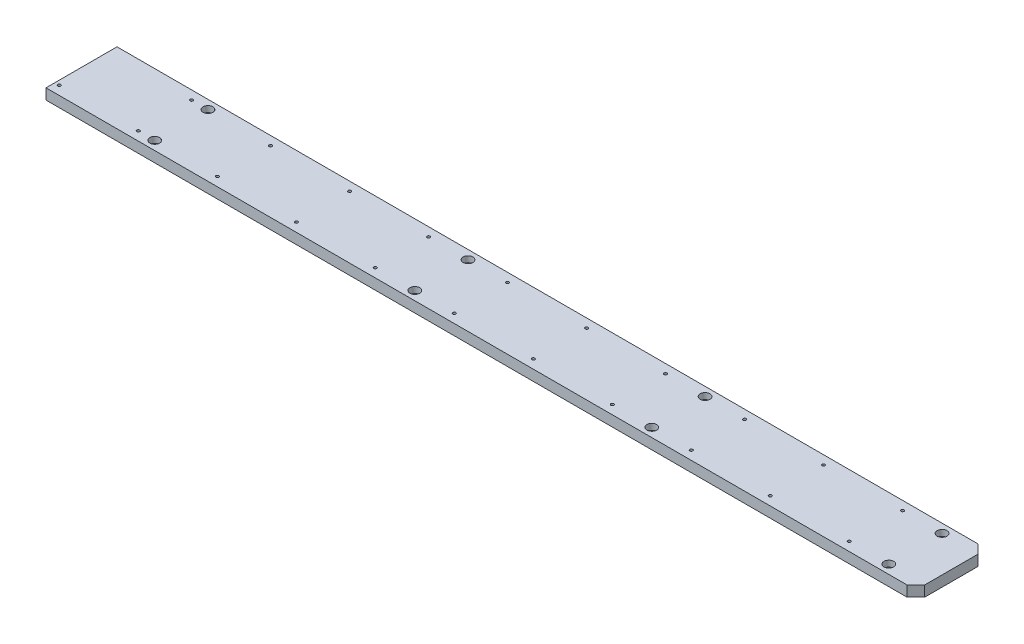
ISO-10303-21;
HEADER;
FILE_DESCRIPTION(('STEP AP214'),'2;1');
FILE_NAME('part.step','',(''),(''),'','','');
FILE_SCHEMA(('AUTOMOTIVE_DESIGN { 1 0 10303 214 1 1 1 1 }'));
ENDSEC;
DATA;
#1=APPLICATION_CONTEXT('core data for automotive mechanical design processes');
#2=APPLICATION_PROTOCOL_DEFINITION('international standard','automotive_design',2000,#1);
#3=PRODUCT_CONTEXT('',#1,'mechanical');
#4=PRODUCT('Part','Part','',(#3));
#5=PRODUCT_RELATED_PRODUCT_CATEGORY('part','',(#4));
#6=PRODUCT_DEFINITION_FORMATION('','',#4);
#7=PRODUCT_DEFINITION_CONTEXT('part definition',#1,'design');
#8=PRODUCT_DEFINITION('design','',#6,#7);
#9=PRODUCT_DEFINITION_SHAPE('','',#8);
#10=(LENGTH_UNIT() NAMED_UNIT(*) SI_UNIT(.MILLI.,.METRE.));
#11=(NAMED_UNIT(*) PLANE_ANGLE_UNIT() SI_UNIT($,.RADIAN.));
#12=(NAMED_UNIT(*) SI_UNIT($,.STERADIAN.) SOLID_ANGLE_UNIT());
#13=UNCERTAINTY_MEASURE_WITH_UNIT(LENGTH_MEASURE(1.E-05),#10,'distance_accuracy_value','');
#14=(GEOMETRIC_REPRESENTATION_CONTEXT(3) GLOBAL_UNCERTAINTY_ASSIGNED_CONTEXT((#13)) GLOBAL_UNIT_ASSIGNED_CONTEXT((#10,
#11,#12)) REPRESENTATION_CONTEXT('',''));
#15=CARTESIAN_POINT('',(0.,0.,0.));
#16=DIRECTION('',(0.,0.,1.));
#17=DIRECTION('',(1.,0.,0.));
#18=AXIS2_PLACEMENT_3D('',#15,#16,#17);
#19=CARTESIAN_POINT('',(-396.000000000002,1.90000000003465,-30.0000000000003));
#20=DIRECTION('',(0.,1.,0.));
#21=DIRECTION('',(-1.,0.,0.));
#22=AXIS2_PLACEMENT_3D('',#19,#20,#21);
#23=CONICAL_SURFACE('',#22,1.65000000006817,1.02974425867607);
#24=CARTESIAN_POINT('',(-396.000000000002,0.908579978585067,-29.9999999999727));
#25=VERTEX_POINT('',#24);
#26=VERTEX_LOOP('',#25);
#27=FACE_BOUND('',#26,.T.);
#28=CARTESIAN_POINT('',(-396.000000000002,1.9,-30.0000000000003));
#29=DIRECTION('',(0.,1.,0.));
#30=DIRECTION('',(0.,0.,1.));
#31=AXIS2_PLACEMENT_3D('',#28,#29,#30);
#32=CIRCLE('',#31,1.64999999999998);
#33=CARTESIAN_POINT('',(-396.000000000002,1.9,-28.3500000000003));
#34=VERTEX_POINT('',#33);
#35=EDGE_CURVE('E135',#34,#34,#32,.T.);
#36=ORIENTED_EDGE('',*,*,#35,.T.);
#37=EDGE_LOOP('',(#36));
#38=FACE_BOUND('',#37,.T.);
#39=ADVANCED_FACE('F17',(#27,#38),#23,.F.);
#40=CARTESIAN_POINT('',(-307.000000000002,1.90000000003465,-29.9999999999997));
#41=DIRECTION('',(0.,1.,0.));
#42=DIRECTION('',(-1.,0.,0.));
#43=AXIS2_PLACEMENT_3D('',#40,#41,#42);
#44=CONICAL_SURFACE('',#43,1.65000000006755,1.02974425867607);
#45=CARTESIAN_POINT('',(-307.000000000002,0.908579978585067,-29.9999999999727));
#46=VERTEX_POINT('',#45);
#47=VERTEX_LOOP('',#46);
#48=FACE_BOUND('',#47,.T.);
#49=CARTESIAN_POINT('',(-307.000000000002,1.9,-29.9999999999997));
#50=DIRECTION('',(0.,1.,0.));
#51=DIRECTION('',(0.,0.,1.));
#52=AXIS2_PLACEMENT_3D('',#49,#50,#51);
#53=CIRCLE('',#52,1.64999999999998);
#54=CARTESIAN_POINT('',(-307.000000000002,1.9,-28.3499999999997));
#55=VERTEX_POINT('',#54);
#56=EDGE_CURVE('E137',#55,#55,#53,.T.);
#57=ORIENTED_EDGE('',*,*,#56,.T.);
#58=EDGE_LOOP('',(#57));
#59=FACE_BOUND('',#58,.T.);
#60=ADVANCED_FACE('F132',(#48,#59),#44,.F.);
#61=CARTESIAN_POINT('',(-218.000000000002,1.90000000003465,-29.9999999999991));
#62=DIRECTION('',(0.,1.,0.));
#63=DIRECTION('',(-1.,0.,0.));
#64=AXIS2_PLACEMENT_3D('',#61,#62,#63);
#65=CONICAL_SURFACE('',#64,1.65000000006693,1.02974425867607);
#66=CARTESIAN_POINT('',(-218.000000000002,0.908579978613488,-29.9999999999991));
#67=VERTEX_POINT('',#66);
#68=VERTEX_LOOP('',#67);
#69=FACE_BOUND('',#68,.T.);
#70=CARTESIAN_POINT('',(-218.000000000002,1.9,-29.9999999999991));
#71=DIRECTION('',(0.,1.,0.));
#72=DIRECTION('',(0.,0.,1.));
#73=AXIS2_PLACEMENT_3D('',#70,#71,#72);
#74=CIRCLE('',#73,1.64999999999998);
#75=CARTESIAN_POINT('',(-218.000000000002,1.9,-28.3499999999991));
#76=VERTEX_POINT('',#75);
#77=EDGE_CURVE('E140',#76,#76,#74,.T.);
#78=ORIENTED_EDGE('',*,*,#77,.T.);
#79=EDGE_LOOP('',(#78));
#80=FACE_BOUND('',#79,.T.);
#81=ADVANCED_FACE('F367',(#69,#80),#65,.F.);
#82=CARTESIAN_POINT('',(-129.000000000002,1.90000000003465,-29.9999999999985));
#83=DIRECTION('',(0.,1.,0.));
#84=DIRECTION('',(-1.,0.,0.));
#85=AXIS2_PLACEMENT_3D('',#82,#83,#84);
#86=CONICAL_SURFACE('',#85,1.65000000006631,1.02974425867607);
#87=CARTESIAN_POINT('',(-129.000000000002,0.908579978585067,-29.9999999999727));
#88=VERTEX_POINT('',#87);
#89=VERTEX_LOOP('',#88);
#90=FACE_BOUND('',#89,.T.);
#91=CARTESIAN_POINT('',(-129.000000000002,1.9,-29.9999999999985));
#92=DIRECTION('',(0.,1.,0.));
#93=DIRECTION('',(0.,0.,1.));
#94=AXIS2_PLACEMENT_3D('',#91,#92,#93);
#95=CIRCLE('',#94,1.64999999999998);
#96=CARTESIAN_POINT('',(-129.000000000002,1.9,-28.3499999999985));
#97=VERTEX_POINT('',#96);
#98=EDGE_CURVE('E362',#97,#97,#95,.T.);
#99=ORIENTED_EDGE('',*,*,#98,.T.);
#100=EDGE_LOOP('',(#99));
#101=FACE_BOUND('',#100,.T.);
#102=ADVANCED_FACE('F594',(#90,#101),#86,.F.);
#103=CARTESIAN_POINT('',(-40.000000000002,1.89999999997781,-29.9999999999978));
#104=DIRECTION('',(0.,1.,0.));
#105=DIRECTION('',(0.,0.,1.));
#106=AXIS2_PLACEMENT_3D('',#103,#104,#105);
#107=CONICAL_SURFACE('',#106,1.65000000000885,1.02974425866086);
#108=CARTESIAN_POINT('',(-40.000000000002,0.908579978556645,-30.0000000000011));
#109=VERTEX_POINT('',#108);
#110=VERTEX_LOOP('',#109);
#111=FACE_BOUND('',#110,.T.);
#112=CARTESIAN_POINT('',(-40.000000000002,1.9,-29.9999999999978));
#113=DIRECTION('',(0.,1.,0.));
#114=DIRECTION('',(0.,0.,1.));
#115=AXIS2_PLACEMENT_3D('',#112,#113,#114);
#116=CIRCLE('',#115,1.65);
#117=CARTESIAN_POINT('',(-40.000000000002,1.9,-28.3499999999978));
#118=VERTEX_POINT('',#117);
#119=EDGE_CURVE('E359',#118,#118,#116,.T.);
#120=ORIENTED_EDGE('',*,*,#119,.T.);
#121=EDGE_LOOP('',(#120));
#122=FACE_BOUND('',#121,.T.);
#123=ADVANCED_FACE('F591',(#111,#122),#107,.F.);
#124=CARTESIAN_POINT('',(48.9999999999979,1.89999999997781,-29.9999999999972));
#125=DIRECTION('',(0.,1.,0.));
#126=DIRECTION('',(0.,0.,1.));
#127=AXIS2_PLACEMENT_3D('',#124,#125,#126);
#128=CONICAL_SURFACE('',#127,1.65000000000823,1.02974425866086);
#129=CARTESIAN_POINT('',(48.9999999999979,0.908579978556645,-30.0000000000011));
#130=VERTEX_POINT('',#129);
#131=VERTEX_LOOP('',#130);
#132=FACE_BOUND('',#131,.T.);
#133=CARTESIAN_POINT('',(48.9999999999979,1.9,-29.9999999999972));
#134=DIRECTION('',(0.,1.,0.));
#135=DIRECTION('',(0.,0.,1.));
#136=AXIS2_PLACEMENT_3D('',#133,#134,#135);
#137=CIRCLE('',#136,1.65);
#138=CARTESIAN_POINT('',(48.9999999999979,1.9,-28.3499999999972));
#139=VERTEX_POINT('',#138);
#140=EDGE_CURVE('E356',#139,#139,#137,.T.);
#141=ORIENTED_EDGE('',*,*,#140,.T.);
#142=EDGE_LOOP('',(#141));
#143=FACE_BOUND('',#142,.T.);
#144=ADVANCED_FACE('F593',(#132,#143),#128,.F.);
#145=CARTESIAN_POINT('',(137.999999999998,1.90000000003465,-29.9999999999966));
#146=DIRECTION('',(0.,1.,0.));
#147=DIRECTION('',(-1.,0.,0.));
#148=AXIS2_PLACEMENT_3D('',#145,#146,#147);
#149=CONICAL_SURFACE('',#148,1.65000000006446,1.02974425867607);
#150=CARTESIAN_POINT('',(137.999999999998,0.908579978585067,-29.9999999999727));
#151=VERTEX_POINT('',#150);
#152=VERTEX_LOOP('',#151);
#153=FACE_BOUND('',#152,.T.);
#154=CARTESIAN_POINT('',(137.999999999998,1.9,-29.9999999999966));
#155=DIRECTION('',(0.,1.,0.));
#156=DIRECTION('',(0.,0.,1.));
#157=AXIS2_PLACEMENT_3D('',#154,#155,#156);
#158=CIRCLE('',#157,1.64999999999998);
#159=CARTESIAN_POINT('',(137.999999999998,1.9,-28.3499999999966));
#160=VERTEX_POINT('',#159);
#161=EDGE_CURVE('E353',#160,#160,#158,.T.);
#162=ORIENTED_EDGE('',*,*,#161,.T.);
#163=EDGE_LOOP('',(#162));
#164=FACE_BOUND('',#163,.T.);
#165=ADVANCED_FACE('F601',(#153,#164),#149,.F.);
#166=CARTESIAN_POINT('',(226.999999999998,1.90000000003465,-29.999999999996));
#167=DIRECTION('',(0.,1.,0.));
#168=DIRECTION('',(-1.,0.,0.));
#169=AXIS2_PLACEMENT_3D('',#166,#167,#168);
#170=CONICAL_SURFACE('',#169,1.65000000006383,1.02974425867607);
#171=CARTESIAN_POINT('',(226.999999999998,0.908579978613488,-29.999999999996));
#172=VERTEX_POINT('',#171);
#173=VERTEX_LOOP('',#172);
#174=FACE_BOUND('',#173,.T.);
#175=CARTESIAN_POINT('',(226.999999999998,1.9,-29.999999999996));
#176=DIRECTION('',(0.,1.,0.));
#177=DIRECTION('',(0.,0.,1.));
#178=AXIS2_PLACEMENT_3D('',#175,#176,#177);
#179=CIRCLE('',#178,1.64999999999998);
#180=CARTESIAN_POINT('',(226.999999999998,1.9,-28.349999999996));
#181=VERTEX_POINT('',#180);
#182=EDGE_CURVE('E350',#181,#181,#179,.T.);
#183=ORIENTED_EDGE('',*,*,#182,.T.);
#184=EDGE_LOOP('',(#183));
#185=FACE_BOUND('',#184,.T.);
#186=ADVANCED_FACE('F650',(#174,#185),#170,.F.);
#187=CARTESIAN_POINT('',(315.999999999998,1.90000000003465,-29.9999999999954));
#188=DIRECTION('',(0.,1.,0.));
#189=DIRECTION('',(-1.,0.,0.));
#190=AXIS2_PLACEMENT_3D('',#187,#188,#189);
#191=CONICAL_SURFACE('',#190,1.65000000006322,1.02974425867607);
#192=CARTESIAN_POINT('',(315.999999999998,0.908579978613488,-29.9999999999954));
#193=VERTEX_POINT('',#192);
#194=VERTEX_LOOP('',#193);
#195=FACE_BOUND('',#194,.T.);
#196=CARTESIAN_POINT('',(315.999999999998,1.9,-29.9999999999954));
#197=DIRECTION('',(0.,1.,0.));
#198=DIRECTION('',(0.,0.,1.));
#199=AXIS2_PLACEMENT_3D('',#196,#197,#198);
#200=CIRCLE('',#199,1.64999999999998);
#201=CARTESIAN_POINT('',(315.999999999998,1.9,-28.3499999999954));
#202=VERTEX_POINT('',#201);
#203=EDGE_CURVE('E347',#202,#202,#200,.T.);
#204=ORIENTED_EDGE('',*,*,#203,.T.);
#205=EDGE_LOOP('',(#204));
#206=FACE_BOUND('',#205,.T.);
#207=ADVANCED_FACE('F659',(#195,#206),#191,.F.);
#208=CARTESIAN_POINT('',(404.999999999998,1.90000000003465,-29.9999999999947));
#209=DIRECTION('',(0.,1.,0.));
#210=DIRECTION('',(-1.,0.,0.));
#211=AXIS2_PLACEMENT_3D('',#208,#209,#210);
#212=CONICAL_SURFACE('',#211,1.65000000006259,1.02974425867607);
#213=CARTESIAN_POINT('',(404.999999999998,0.908579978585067,-29.9999999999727));
#214=VERTEX_POINT('',#213);
#215=VERTEX_LOOP('',#214);
#216=FACE_BOUND('',#215,.T.);
#217=CARTESIAN_POINT('',(404.999999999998,1.9,-29.9999999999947));
#218=DIRECTION('',(0.,1.,0.));
#219=DIRECTION('',(0.,0.,1.));
#220=AXIS2_PLACEMENT_3D('',#217,#218,#219);
#221=CIRCLE('',#220,1.64999999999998);
#222=CARTESIAN_POINT('',(404.999999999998,1.9,-28.3499999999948));
#223=VERTEX_POINT('',#222);
#224=EDGE_CURVE('E344',#223,#223,#221,.T.);
#225=ORIENTED_EDGE('',*,*,#224,.T.);
#226=EDGE_LOOP('',(#225));
#227=FACE_BOUND('',#226,.T.);
#228=ADVANCED_FACE('F669',(#216,#227),#212,.F.);
#229=CARTESIAN_POINT('',(-485.,1.90000000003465,29.9999999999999));
#230=DIRECTION('',(0.,1.,0.));
#231=DIRECTION('',(-1.,0.,0.));
#232=AXIS2_PLACEMENT_3D('',#229,#230,#231);
#233=CONICAL_SURFACE('',#232,1.65000000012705,1.02974425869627);
#234=CARTESIAN_POINT('',(-485.,0.908579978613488,29.9999999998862));
#235=VERTEX_POINT('',#234);
#236=VERTEX_LOOP('',#235);
#237=FACE_BOUND('',#236,.T.);
#238=CARTESIAN_POINT('',(-485.,1.9,29.9999999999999));
#239=DIRECTION('',(0.,1.,0.));
#240=DIRECTION('',(0.,0.,1.));
#241=AXIS2_PLACEMENT_3D('',#238,#239,#240);
#242=CIRCLE('',#241,1.64999999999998);
#243=CARTESIAN_POINT('',(-485.,1.9,31.6499999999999));
#244=VERTEX_POINT('',#243);
#245=EDGE_CURVE('E341',#244,#244,#242,.T.);
#246=ORIENTED_EDGE('',*,*,#245,.T.);
#247=EDGE_LOOP('',(#246));
#248=FACE_BOUND('',#247,.T.);
#249=ADVANCED_FACE('F679',(#237,#248),#233,.F.);
#250=CARTESIAN_POINT('',(-396.,1.90000000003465,29.9999999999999));
#251=DIRECTION('',(0.,1.,0.));
#252=DIRECTION('',(-1.,0.,0.));
#253=AXIS2_PLACEMENT_3D('',#250,#251,#252);
#254=CONICAL_SURFACE('',#253,1.65000000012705,1.02974425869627);
#255=CARTESIAN_POINT('',(-396.,0.908579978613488,30.0000000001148));
#256=VERTEX_POINT('',#255);
#257=VERTEX_LOOP('',#256);
#258=FACE_BOUND('',#257,.T.);
#259=CARTESIAN_POINT('',(-396.,1.9,29.9999999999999));
#260=DIRECTION('',(0.,1.,0.));
#261=DIRECTION('',(0.,0.,1.));
#262=AXIS2_PLACEMENT_3D('',#259,#260,#261);
#263=CIRCLE('',#262,1.64999999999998);
#264=CARTESIAN_POINT('',(-396.,1.9,31.6499999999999));
#265=VERTEX_POINT('',#264);
#266=EDGE_CURVE('E338',#265,#265,#263,.T.);
#267=ORIENTED_EDGE('',*,*,#266,.T.);
#268=EDGE_LOOP('',(#267));
#269=FACE_BOUND('',#268,.T.);
#270=ADVANCED_FACE('F689',(#258,#269),#254,.F.);
#271=CARTESIAN_POINT('',(-307.,1.90000000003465,29.9999999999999));
#272=DIRECTION('',(0.,1.,0.));
#273=DIRECTION('',(-1.,0.,0.));
#274=AXIS2_PLACEMENT_3D('',#271,#272,#273);
#275=CONICAL_SURFACE('',#274,1.65000000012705,1.02974425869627);
#276=CARTESIAN_POINT('',(-307.,0.908579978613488,30.0000000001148));
#277=VERTEX_POINT('',#276);
#278=VERTEX_LOOP('',#277);
#279=FACE_BOUND('',#278,.T.);
#280=CARTESIAN_POINT('',(-307.,1.9,29.9999999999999));
#281=DIRECTION('',(0.,1.,0.));
#282=DIRECTION('',(0.,0.,1.));
#283=AXIS2_PLACEMENT_3D('',#280,#281,#282);
#284=CIRCLE('',#283,1.64999999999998);
#285=CARTESIAN_POINT('',(-307.,1.9,31.6499999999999));
#286=VERTEX_POINT('',#285);
#287=EDGE_CURVE('E335',#286,#286,#284,.T.);
#288=ORIENTED_EDGE('',*,*,#287,.T.);
#289=EDGE_LOOP('',(#288));
#290=FACE_BOUND('',#289,.T.);
#291=ADVANCED_FACE('F699',(#279,#290),#275,.F.);
#292=CARTESIAN_POINT('',(-218.,1.90000000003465,29.9999999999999));
#293=DIRECTION('',(0.,1.,0.));
#294=DIRECTION('',(-1.,0.,0.));
#295=AXIS2_PLACEMENT_3D('',#292,#293,#294);
#296=CONICAL_SURFACE('',#295,1.65000000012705,1.02974425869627);
#297=CARTESIAN_POINT('',(-218.,0.908579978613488,29.9999999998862));
#298=VERTEX_POINT('',#297);
#299=VERTEX_LOOP('',#298);
#300=FACE_BOUND('',#299,.T.);
#301=CARTESIAN_POINT('',(-218.,1.9,29.9999999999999));
#302=DIRECTION('',(0.,1.,0.));
#303=DIRECTION('',(0.,0.,1.));
#304=AXIS2_PLACEMENT_3D('',#301,#302,#303);
#305=CIRCLE('',#304,1.64999999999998);
#306=CARTESIAN_POINT('',(-218.,1.9,31.6499999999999));
#307=VERTEX_POINT('',#306);
#308=EDGE_CURVE('E332',#307,#307,#305,.T.);
#309=ORIENTED_EDGE('',*,*,#308,.T.);
#310=EDGE_LOOP('',(#309));
#311=FACE_BOUND('',#310,.T.);
#312=ADVANCED_FACE('F709',(#300,#311),#296,.F.);
#313=CARTESIAN_POINT('',(-129.,1.90000000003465,29.9999999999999));
#314=DIRECTION('',(0.,1.,0.));
#315=DIRECTION('',(-1.,0.,0.));
#316=AXIS2_PLACEMENT_3D('',#313,#314,#315);
#317=CONICAL_SURFACE('',#316,1.65000000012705,1.02974425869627);
#318=CARTESIAN_POINT('',(-129.,0.908579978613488,30.0000000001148));
#319=VERTEX_POINT('',#318);
#320=VERTEX_LOOP('',#319);
#321=FACE_BOUND('',#320,.T.);
#322=CARTESIAN_POINT('',(-129.,1.9,29.9999999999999));
#323=DIRECTION('',(0.,1.,0.));
#324=DIRECTION('',(0.,0.,1.));
#325=AXIS2_PLACEMENT_3D('',#322,#323,#324);
#326=CIRCLE('',#325,1.64999999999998);
#327=CARTESIAN_POINT('',(-129.,1.9,31.6499999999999));
#328=VERTEX_POINT('',#327);
#329=EDGE_CURVE('E329',#328,#328,#326,.T.);
#330=ORIENTED_EDGE('',*,*,#329,.T.);
#331=EDGE_LOOP('',(#330));
#332=FACE_BOUND('',#331,.T.);
#333=ADVANCED_FACE('F719',(#321,#332),#317,.F.);
#334=CARTESIAN_POINT('',(-40.,1.89999999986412,29.9999999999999));
#335=DIRECTION('',(0.,1.,0.));
#336=DIRECTION('',(-1.,0.,0.));
#337=AXIS2_PLACEMENT_3D('',#334,#335,#336);
#338=CONICAL_SURFACE('',#337,1.64999999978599,1.02974425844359);
#339=CARTESIAN_POINT('',(-40.,0.90857997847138,29.9999999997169));
#340=VERTEX_POINT('',#339);
#341=VERTEX_LOOP('',#340);
#342=FACE_BOUND('',#341,.T.);
#343=CARTESIAN_POINT('',(-40.,1.9,29.9999999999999));
#344=DIRECTION('',(0.,1.,0.));
#345=DIRECTION('',(0.,0.,1.));
#346=AXIS2_PLACEMENT_3D('',#343,#344,#345);
#347=CIRCLE('',#346,1.65);
#348=CARTESIAN_POINT('',(-40.,1.9,31.6499999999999));
#349=VERTEX_POINT('',#348);
#350=EDGE_CURVE('E326',#349,#349,#347,.T.);
#351=ORIENTED_EDGE('',*,*,#350,.T.);
#352=EDGE_LOOP('',(#351));
#353=FACE_BOUND('',#352,.T.);
#354=ADVANCED_FACE('F729',(#342,#353),#338,.F.);
#355=CARTESIAN_POINT('',(48.9999999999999,1.89999999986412,29.9999999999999));
#356=DIRECTION('',(0.,1.,0.));
#357=DIRECTION('',(-1.,0.,0.));
#358=AXIS2_PLACEMENT_3D('',#355,#356,#357);
#359=CONICAL_SURFACE('',#358,1.64999999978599,1.02974425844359);
#360=CARTESIAN_POINT('',(48.9999999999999,0.90857997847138,29.9999999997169));
#361=VERTEX_POINT('',#360);
#362=VERTEX_LOOP('',#361);
#363=FACE_BOUND('',#362,.T.);
#364=CARTESIAN_POINT('',(48.9999999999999,1.9,29.9999999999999));
#365=DIRECTION('',(0.,1.,0.));
#366=DIRECTION('',(0.,0.,1.));
#367=AXIS2_PLACEMENT_3D('',#364,#365,#366);
#368=CIRCLE('',#367,1.65);
#369=CARTESIAN_POINT('',(48.9999999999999,1.9,31.6499999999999));
#370=VERTEX_POINT('',#369);
#371=EDGE_CURVE('E323',#370,#370,#368,.T.);
#372=ORIENTED_EDGE('',*,*,#371,.T.);
#373=EDGE_LOOP('',(#372));
#374=FACE_BOUND('',#373,.T.);
#375=ADVANCED_FACE('F739',(#363,#374),#359,.F.);
#376=CARTESIAN_POINT('',(138.,1.90000000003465,29.9999999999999));
#377=DIRECTION('',(0.,1.,0.));
#378=DIRECTION('',(-1.,0.,0.));
#379=AXIS2_PLACEMENT_3D('',#376,#377,#378);
#380=CONICAL_SURFACE('',#379,1.65000000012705,1.02974425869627);
#381=CARTESIAN_POINT('',(138.,0.908579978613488,30.0000000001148));
#382=VERTEX_POINT('',#381);
#383=VERTEX_LOOP('',#382);
#384=FACE_BOUND('',#383,.T.);
#385=CARTESIAN_POINT('',(138.,1.9,29.9999999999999));
#386=DIRECTION('',(0.,1.,0.));
#387=DIRECTION('',(0.,0.,1.));
#388=AXIS2_PLACEMENT_3D('',#385,#386,#387);
#389=CIRCLE('',#388,1.64999999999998);
#390=CARTESIAN_POINT('',(138.,1.9,31.6499999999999));
#391=VERTEX_POINT('',#390);
#392=EDGE_CURVE('E320',#391,#391,#389,.T.);
#393=ORIENTED_EDGE('',*,*,#392,.T.);
#394=EDGE_LOOP('',(#393));
#395=FACE_BOUND('',#394,.T.);
#396=ADVANCED_FACE('F749',(#384,#395),#380,.F.);
#397=CARTESIAN_POINT('',(227.,1.90000000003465,29.9999999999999));
#398=DIRECTION('',(0.,1.,0.));
#399=DIRECTION('',(-1.,0.,0.));
#400=AXIS2_PLACEMENT_3D('',#397,#398,#399);
#401=CONICAL_SURFACE('',#400,1.65000000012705,1.02974425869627);
#402=CARTESIAN_POINT('',(227.,0.908579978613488,29.9999999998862));
#403=VERTEX_POINT('',#402);
#404=VERTEX_LOOP('',#403);
#405=FACE_BOUND('',#404,.T.);
#406=CARTESIAN_POINT('',(227.,1.9,29.9999999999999));
#407=DIRECTION('',(0.,1.,0.));
#408=DIRECTION('',(0.,0.,1.));
#409=AXIS2_PLACEMENT_3D('',#406,#407,#408);
#410=CIRCLE('',#409,1.64999999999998);
#411=CARTESIAN_POINT('',(227.,1.9,31.6499999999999));
#412=VERTEX_POINT('',#411);
#413=EDGE_CURVE('E313',#412,#412,#410,.T.);
#414=ORIENTED_EDGE('',*,*,#413,.T.);
#415=EDGE_LOOP('',(#414));
#416=FACE_BOUND('',#415,.T.);
#417=ADVANCED_FACE('F759',(#405,#416),#401,.F.);
#418=CARTESIAN_POINT('',(316.,1.90000000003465,29.9999999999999));
#419=DIRECTION('',(0.,1.,0.));
#420=DIRECTION('',(-1.,0.,0.));
#421=AXIS2_PLACEMENT_3D('',#418,#419,#420);
#422=CONICAL_SURFACE('',#421,1.65000000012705,1.02974425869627);
#423=CARTESIAN_POINT('',(316.,0.908579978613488,29.9999999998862));
#424=VERTEX_POINT('',#423);
#425=VERTEX_LOOP('',#424);
#426=FACE_BOUND('',#425,.T.);
#427=CARTESIAN_POINT('',(316.,1.9,29.9999999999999));
#428=DIRECTION('',(0.,1.,0.));
#429=DIRECTION('',(0.,0.,1.));
#430=AXIS2_PLACEMENT_3D('',#427,#428,#429);
#431=CIRCLE('',#430,1.64999999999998);
#432=CARTESIAN_POINT('',(316.,1.9,31.6499999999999));
#433=VERTEX_POINT('',#432);
#434=EDGE_CURVE('E308',#433,#433,#431,.T.);
#435=ORIENTED_EDGE('',*,*,#434,.T.);
#436=EDGE_LOOP('',(#435));
#437=FACE_BOUND('',#436,.T.);
#438=ADVANCED_FACE('F769',(#426,#437),#422,.F.);
#439=CARTESIAN_POINT('',(405.,1.90000000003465,29.9999999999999));
#440=DIRECTION('',(0.,1.,0.));
#441=DIRECTION('',(-1.,0.,0.));
#442=AXIS2_PLACEMENT_3D('',#439,#440,#441);
#443=CONICAL_SURFACE('',#442,1.65000000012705,1.02974425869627);
#444=CARTESIAN_POINT('',(405.,0.908579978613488,30.0000000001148));
#445=VERTEX_POINT('',#444);
#446=VERTEX_LOOP('',#445);
#447=FACE_BOUND('',#446,.T.);
#448=CARTESIAN_POINT('',(405.,1.9,29.9999999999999));
#449=DIRECTION('',(0.,1.,0.));
#450=DIRECTION('',(0.,0.,1.));
#451=AXIS2_PLACEMENT_3D('',#448,#449,#450);
#452=CIRCLE('',#451,1.64999999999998);
#453=CARTESIAN_POINT('',(405.,1.9,31.6499999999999));
#454=VERTEX_POINT('',#453);
#455=EDGE_CURVE('E304',#454,#454,#452,.T.);
#456=ORIENTED_EDGE('',*,*,#455,.T.);
#457=EDGE_LOOP('',(#456));
#458=FACE_BOUND('',#457,.T.);
#459=ADVANCED_FACE('F779',(#447,#458),#443,.F.);
#460=CARTESIAN_POINT('',(-396.000000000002,12.,-30.0000000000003));
#461=DIRECTION('',(0.,1.,0.));
#462=DIRECTION('',(0.,0.,1.));
#463=AXIS2_PLACEMENT_3D('',#460,#461,#462);
#464=CYLINDRICAL_SURFACE('',#463,1.64999999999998);
#465=CARTESIAN_POINT('',(-396.000000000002,12.,-30.0000000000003));
#466=DIRECTION('',(0.,1.,0.));
#467=DIRECTION('',(0.,0.,1.));
#468=AXIS2_PLACEMENT_3D('',#465,#466,#467);
#469=CIRCLE('',#468,1.64999999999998);
#470=CARTESIAN_POINT('',(-396.000000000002,12.,-28.3500000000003));
#471=VERTEX_POINT('',#470);
#472=EDGE_CURVE('E279',#471,#471,#469,.F.);
#473=ORIENTED_EDGE('',*,*,#472,.F.);
#474=EDGE_LOOP('',(#473));
#475=FACE_BOUND('',#474,.T.);
#476=ORIENTED_EDGE('',*,*,#35,.F.);
#477=EDGE_LOOP('',(#476));
#478=FACE_BOUND('',#477,.T.);
#479=ADVANCED_FACE('F383',(#475,#478),#464,.F.);
#480=CARTESIAN_POINT('',(-307.000000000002,12.,-29.9999999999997));
#481=DIRECTION('',(0.,1.,0.));
#482=DIRECTION('',(0.,0.,1.));
#483=AXIS2_PLACEMENT_3D('',#480,#481,#482);
#484=CYLINDRICAL_SURFACE('',#483,1.64999999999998);
#485=CARTESIAN_POINT('',(-307.000000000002,12.,-29.9999999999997));
#486=DIRECTION('',(0.,1.,0.));
#487=DIRECTION('',(0.,0.,1.));
#488=AXIS2_PLACEMENT_3D('',#485,#486,#487);
#489=CIRCLE('',#488,1.64999999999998);
#490=CARTESIAN_POINT('',(-307.000000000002,12.,-28.3499999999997));
#491=VERTEX_POINT('',#490);
#492=EDGE_CURVE('E276',#491,#491,#489,.F.);
#493=ORIENTED_EDGE('',*,*,#492,.F.);
#494=EDGE_LOOP('',(#493));
#495=FACE_BOUND('',#494,.T.);
#496=ORIENTED_EDGE('',*,*,#56,.F.);
#497=EDGE_LOOP('',(#496));
#498=FACE_BOUND('',#497,.T.);
#499=ADVANCED_FACE('F372',(#495,#498),#484,.F.);
#500=CARTESIAN_POINT('',(-218.000000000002,12.,-29.9999999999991));
#501=DIRECTION('',(0.,1.,0.));
#502=DIRECTION('',(0.,0.,1.));
#503=AXIS2_PLACEMENT_3D('',#500,#501,#502);
#504=CYLINDRICAL_SURFACE('',#503,1.64999999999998);
#505=CARTESIAN_POINT('',(-218.000000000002,12.,-29.9999999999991));
#506=DIRECTION('',(0.,1.,0.));
#507=DIRECTION('',(0.,0.,1.));
#508=AXIS2_PLACEMENT_3D('',#505,#506,#507);
#509=CIRCLE('',#508,1.64999999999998);
#510=CARTESIAN_POINT('',(-218.000000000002,12.,-28.3499999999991));
#511=VERTEX_POINT('',#510);
#512=EDGE_CURVE('E273',#511,#511,#509,.F.);
#513=ORIENTED_EDGE('',*,*,#512,.F.);
#514=EDGE_LOOP('',(#513));
#515=FACE_BOUND('',#514,.T.);
#516=ORIENTED_EDGE('',*,*,#77,.F.);
#517=EDGE_LOOP('',(#516));
#518=FACE_BOUND('',#517,.T.);
#519=ADVANCED_FACE('F369',(#515,#518),#504,.F.);
#520=CARTESIAN_POINT('',(-129.000000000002,12.,-29.9999999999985));
#521=DIRECTION('',(0.,1.,0.));
#522=DIRECTION('',(0.,0.,1.));
#523=AXIS2_PLACEMENT_3D('',#520,#521,#522);
#524=CYLINDRICAL_SURFACE('',#523,1.64999999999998);
#525=CARTESIAN_POINT('',(-129.000000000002,12.,-29.9999999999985));
#526=DIRECTION('',(0.,1.,0.));
#527=DIRECTION('',(0.,0.,1.));
#528=AXIS2_PLACEMENT_3D('',#525,#526,#527);
#529=CIRCLE('',#528,1.64999999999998);
#530=CARTESIAN_POINT('',(-129.000000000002,12.,-28.3499999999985));
#531=VERTEX_POINT('',#530);
#532=EDGE_CURVE('E270',#531,#531,#529,.F.);
#533=ORIENTED_EDGE('',*,*,#532,.F.);
#534=EDGE_LOOP('',(#533));
#535=FACE_BOUND('',#534,.T.);
#536=ORIENTED_EDGE('',*,*,#98,.F.);
#537=EDGE_LOOP('',(#536));
#538=FACE_BOUND('',#537,.T.);
#539=ADVANCED_FACE('F371',(#535,#538),#524,.F.);
#540=CARTESIAN_POINT('',(-40.000000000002,12.,-29.9999999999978));
#541=DIRECTION('',(0.,1.,0.));
#542=DIRECTION('',(0.,0.,1.));
#543=AXIS2_PLACEMENT_3D('',#540,#541,#542);
#544=CYLINDRICAL_SURFACE('',#543,1.65);
#545=CARTESIAN_POINT('',(-40.000000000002,12.,-29.9999999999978));
#546=DIRECTION('',(0.,1.,0.));
#547=DIRECTION('',(0.,0.,1.));
#548=AXIS2_PLACEMENT_3D('',#545,#546,#547);
#549=CIRCLE('',#548,1.65);
#550=CARTESIAN_POINT('',(-40.000000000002,12.,-28.3499999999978));
#551=VERTEX_POINT('',#550);
#552=EDGE_CURVE('E267',#551,#551,#549,.F.);
#553=ORIENTED_EDGE('',*,*,#552,.F.);
#554=EDGE_LOOP('',(#553));
#555=FACE_BOUND('',#554,.T.);
#556=ORIENTED_EDGE('',*,*,#119,.F.);
#557=EDGE_LOOP('',(#556));
#558=FACE_BOUND('',#557,.T.);
#559=ADVANCED_FACE('F380',(#555,#558),#544,.F.);
#560=CARTESIAN_POINT('',(48.9999999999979,12.,-29.9999999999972));
#561=DIRECTION('',(0.,1.,0.));
#562=DIRECTION('',(0.,0.,1.));
#563=AXIS2_PLACEMENT_3D('',#560,#561,#562);
#564=CYLINDRICAL_SURFACE('',#563,1.65);
#565=CARTESIAN_POINT('',(48.9999999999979,12.,-29.9999999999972));
#566=DIRECTION('',(0.,1.,0.));
#567=DIRECTION('',(0.,0.,1.));
#568=AXIS2_PLACEMENT_3D('',#565,#566,#567);
#569=CIRCLE('',#568,1.65);
#570=CARTESIAN_POINT('',(48.9999999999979,12.,-28.3499999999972));
#571=VERTEX_POINT('',#570);
#572=EDGE_CURVE('E264',#571,#571,#569,.F.);
#573=ORIENTED_EDGE('',*,*,#572,.F.);
#574=EDGE_LOOP('',(#573));
#575=FACE_BOUND('',#574,.T.);
#576=ORIENTED_EDGE('',*,*,#140,.F.);
#577=EDGE_LOOP('',(#576));
#578=FACE_BOUND('',#577,.T.);
#579=ADVANCED_FACE('F578',(#575,#578),#564,.F.);
#580=CARTESIAN_POINT('',(137.999999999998,12.,-29.9999999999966));
#581=DIRECTION('',(0.,1.,0.));
#582=DIRECTION('',(0.,0.,1.));
#583=AXIS2_PLACEMENT_3D('',#580,#581,#582);
#584=CYLINDRICAL_SURFACE('',#583,1.64999999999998);
#585=CARTESIAN_POINT('',(137.999999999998,12.,-29.9999999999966));
#586=DIRECTION('',(0.,1.,0.));
#587=DIRECTION('',(0.,0.,1.));
#588=AXIS2_PLACEMENT_3D('',#585,#586,#587);
#589=CIRCLE('',#588,1.64999999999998);
#590=CARTESIAN_POINT('',(137.999999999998,12.,-28.3499999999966));
#591=VERTEX_POINT('',#590);
#592=EDGE_CURVE('E261',#591,#591,#589,.F.);
#593=ORIENTED_EDGE('',*,*,#592,.F.);
#594=EDGE_LOOP('',(#593));
#595=FACE_BOUND('',#594,.T.);
#596=ORIENTED_EDGE('',*,*,#161,.F.);
#597=EDGE_LOOP('',(#596));
#598=FACE_BOUND('',#597,.T.);
#599=ADVANCED_FACE('F574',(#595,#598),#584,.F.);
#600=CARTESIAN_POINT('',(226.999999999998,12.,-29.999999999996));
#601=DIRECTION('',(0.,1.,0.));
#602=DIRECTION('',(0.,0.,1.));
#603=AXIS2_PLACEMENT_3D('',#600,#601,#602);
#604=CYLINDRICAL_SURFACE('',#603,1.64999999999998);
#605=CARTESIAN_POINT('',(226.999999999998,12.,-29.999999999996));
#606=DIRECTION('',(0.,1.,0.));
#607=DIRECTION('',(0.,0.,1.));
#608=AXIS2_PLACEMENT_3D('',#605,#606,#607);
#609=CIRCLE('',#608,1.64999999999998);
#610=CARTESIAN_POINT('',(226.999999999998,12.,-28.349999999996));
#611=VERTEX_POINT('',#610);
#612=EDGE_CURVE('E258',#611,#611,#609,.F.);
#613=ORIENTED_EDGE('',*,*,#612,.F.);
#614=EDGE_LOOP('',(#613));
#615=FACE_BOUND('',#614,.T.);
#616=ORIENTED_EDGE('',*,*,#182,.F.);
#617=EDGE_LOOP('',(#616));
#618=FACE_BOUND('',#617,.T.);
#619=ADVANCED_FACE('F570',(#615,#618),#604,.F.);
#620=CARTESIAN_POINT('',(315.999999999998,12.,-29.9999999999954));
#621=DIRECTION('',(0.,1.,0.));
#622=DIRECTION('',(0.,0.,1.));
#623=AXIS2_PLACEMENT_3D('',#620,#621,#622);
#624=CYLINDRICAL_SURFACE('',#623,1.64999999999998);
#625=CARTESIAN_POINT('',(315.999999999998,12.,-29.9999999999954));
#626=DIRECTION('',(0.,1.,0.));
#627=DIRECTION('',(0.,0.,1.));
#628=AXIS2_PLACEMENT_3D('',#625,#626,#627);
#629=CIRCLE('',#628,1.64999999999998);
#630=CARTESIAN_POINT('',(315.999999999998,12.,-28.3499999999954));
#631=VERTEX_POINT('',#630);
#632=EDGE_CURVE('E255',#631,#631,#629,.F.);
#633=ORIENTED_EDGE('',*,*,#632,.F.);
#634=EDGE_LOOP('',(#633));
#635=FACE_BOUND('',#634,.T.);
#636=ORIENTED_EDGE('',*,*,#203,.F.);
#637=EDGE_LOOP('',(#636));
#638=FACE_BOUND('',#637,.T.);
#639=ADVANCED_FACE('F566',(#635,#638),#624,.F.);
#640=CARTESIAN_POINT('',(404.999999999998,12.,-29.9999999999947));
#641=DIRECTION('',(0.,1.,0.));
#642=DIRECTION('',(0.,0.,1.));
#643=AXIS2_PLACEMENT_3D('',#640,#641,#642);
#644=CYLINDRICAL_SURFACE('',#643,1.64999999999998);
#645=CARTESIAN_POINT('',(404.999999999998,12.,-29.9999999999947));
#646=DIRECTION('',(0.,1.,0.));
#647=DIRECTION('',(0.,0.,1.));
#648=AXIS2_PLACEMENT_3D('',#645,#646,#647);
#649=CIRCLE('',#648,1.64999999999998);
#650=CARTESIAN_POINT('',(404.999999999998,12.,-28.3499999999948));
#651=VERTEX_POINT('',#650);
#652=EDGE_CURVE('E252',#651,#651,#649,.F.);
#653=ORIENTED_EDGE('',*,*,#652,.F.);
#654=EDGE_LOOP('',(#653));
#655=FACE_BOUND('',#654,.T.);
#656=ORIENTED_EDGE('',*,*,#224,.F.);
#657=EDGE_LOOP('',(#656));
#658=FACE_BOUND('',#657,.T.);
#659=ADVANCED_FACE('F562',(#655,#658),#644,.F.);
#660=CARTESIAN_POINT('',(-377.499999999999,12.,-29.9999999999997));
#661=DIRECTION('',(0.,1.,0.));
#662=DIRECTION('',(0.,0.,1.));
#663=AXIS2_PLACEMENT_3D('',#660,#661,#662);
#664=CYLINDRICAL_SURFACE('',#663,5.50000000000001);
#665=CARTESIAN_POINT('',(-377.499999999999,12.,-29.9999999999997));
#666=DIRECTION('',(0.,1.,0.));
#667=DIRECTION('',(0.,0.,1.));
#668=AXIS2_PLACEMENT_3D('',#665,#666,#667);
#669=CIRCLE('',#668,5.50000000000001);
#670=CARTESIAN_POINT('',(-377.499999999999,12.,-24.4999999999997));
#671=VERTEX_POINT('',#670);
#672=EDGE_CURVE('E249',#671,#671,#669,.F.);
#673=ORIENTED_EDGE('',*,*,#672,.F.);
#674=EDGE_LOOP('',(#673));
#675=FACE_BOUND('',#674,.T.);
#676=CARTESIAN_POINT('',(-377.499999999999,5.2,-29.9999999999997));
#677=DIRECTION('',(0.,1.,0.));
#678=DIRECTION('',(0.,0.,1.));
#679=AXIS2_PLACEMENT_3D('',#676,#677,#678);
#680=CIRCLE('',#679,5.50000000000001);
#681=CARTESIAN_POINT('',(-377.499999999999,5.2,-24.4999999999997));
#682=VERTEX_POINT('',#681);
#683=EDGE_CURVE('E20',#682,#682,#680,.F.);
#684=ORIENTED_EDGE('',*,*,#683,.T.);
#685=EDGE_LOOP('',(#684));
#686=FACE_BOUND('',#685,.T.);
#687=ADVANCED_FACE('F558',(#675,#686),#664,.F.);
#688=CARTESIAN_POINT('',(-377.499999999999,12.,30.0000000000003));
#689=DIRECTION('',(0.,1.,0.));
#690=DIRECTION('',(0.,0.,1.));
#691=AXIS2_PLACEMENT_3D('',#688,#689,#690);
#692=CYLINDRICAL_SURFACE('',#691,5.5);
#693=CARTESIAN_POINT('',(-377.499999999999,12.,30.0000000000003));
#694=DIRECTION('',(0.,1.,0.));
#695=DIRECTION('',(0.,0.,1.));
#696=AXIS2_PLACEMENT_3D('',#693,#694,#695);
#697=CIRCLE('',#696,5.5);
#698=CARTESIAN_POINT('',(-377.499999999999,12.,35.5000000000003));
#699=VERTEX_POINT('',#698);
#700=EDGE_CURVE('E246',#699,#699,#697,.F.);
#701=ORIENTED_EDGE('',*,*,#700,.F.);
#702=EDGE_LOOP('',(#701));
#703=FACE_BOUND('',#702,.T.);
#704=CARTESIAN_POINT('',(-377.499999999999,5.2,30.0000000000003));
#705=DIRECTION('',(0.,1.,0.));
#706=DIRECTION('',(0.,0.,1.));
#707=AXIS2_PLACEMENT_3D('',#704,#705,#706);
#708=CIRCLE('',#707,5.5);
#709=CARTESIAN_POINT('',(-377.499999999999,5.2,35.5000000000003));
#710=VERTEX_POINT('',#709);
#711=EDGE_CURVE('E299',#710,#710,#708,.F.);
#712=ORIENTED_EDGE('',*,*,#711,.T.);
#713=EDGE_LOOP('',(#712));
#714=FACE_BOUND('',#713,.T.);
#715=ADVANCED_FACE('F554',(#703,#714),#692,.F.);
#716=CARTESIAN_POINT('',(-84.5000000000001,12.,-30.));
#717=DIRECTION('',(0.,1.,0.));
#718=DIRECTION('',(0.,0.,1.));
#719=AXIS2_PLACEMENT_3D('',#716,#717,#718);
#720=CYLINDRICAL_SURFACE('',#719,5.50000000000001);
#721=CARTESIAN_POINT('',(-84.5000000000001,12.,-30.));
#722=DIRECTION('',(0.,1.,0.));
#723=DIRECTION('',(0.,0.,1.));
#724=AXIS2_PLACEMENT_3D('',#721,#722,#723);
#725=CIRCLE('',#724,5.50000000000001);
#726=CARTESIAN_POINT('',(-84.5000000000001,12.,-24.5));
#727=VERTEX_POINT('',#726);
#728=EDGE_CURVE('E243',#727,#727,#725,.F.);
#729=ORIENTED_EDGE('',*,*,#728,.F.);
#730=EDGE_LOOP('',(#729));
#731=FACE_BOUND('',#730,.T.);
#732=CARTESIAN_POINT('',(-84.5000000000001,5.2,-30.));
#733=DIRECTION('',(0.,1.,0.));
#734=DIRECTION('',(0.,0.,1.));
#735=AXIS2_PLACEMENT_3D('',#732,#733,#734);
#736=CIRCLE('',#735,5.50000000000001);
#737=CARTESIAN_POINT('',(-84.5000000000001,5.2,-24.5));
#738=VERTEX_POINT('',#737);
#739=EDGE_CURVE('E297',#738,#738,#736,.F.);
#740=ORIENTED_EDGE('',*,*,#739,.T.);
#741=EDGE_LOOP('',(#740));
#742=FACE_BOUND('',#741,.T.);
#743=ADVANCED_FACE('F550',(#731,#742),#720,.F.);
#744=CARTESIAN_POINT('',(-84.5000000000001,12.,30.));
#745=DIRECTION('',(0.,1.,0.));
#746=DIRECTION('',(0.,0.,1.));
#747=AXIS2_PLACEMENT_3D('',#744,#745,#746);
#748=CYLINDRICAL_SURFACE('',#747,5.5);
#749=CARTESIAN_POINT('',(-84.5000000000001,12.,30.));
#750=DIRECTION('',(0.,1.,0.));
#751=DIRECTION('',(0.,0.,1.));
#752=AXIS2_PLACEMENT_3D('',#749,#750,#751);
#753=CIRCLE('',#752,5.5);
#754=CARTESIAN_POINT('',(-84.5000000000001,12.,35.5));
#755=VERTEX_POINT('',#754);
#756=EDGE_CURVE('E240',#755,#755,#753,.F.);
#757=ORIENTED_EDGE('',*,*,#756,.F.);
#758=EDGE_LOOP('',(#757));
#759=FACE_BOUND('',#758,.T.);
#760=CARTESIAN_POINT('',(-84.5000000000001,5.2,30.));
#761=DIRECTION('',(0.,1.,0.));
#762=DIRECTION('',(0.,0.,1.));
#763=AXIS2_PLACEMENT_3D('',#760,#761,#762);
#764=CIRCLE('',#763,5.5);
#765=CARTESIAN_POINT('',(-84.5000000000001,5.2,35.5));
#766=VERTEX_POINT('',#765);
#767=EDGE_CURVE('E294',#766,#766,#764,.F.);
#768=ORIENTED_EDGE('',*,*,#767,.T.);
#769=EDGE_LOOP('',(#768));
#770=FACE_BOUND('',#769,.T.);
#771=ADVANCED_FACE('F546',(#759,#770),#748,.F.);
#772=CARTESIAN_POINT('',(182.5,12.,-30.));
#773=DIRECTION('',(0.,1.,0.));
#774=DIRECTION('',(0.,0.,1.));
#775=AXIS2_PLACEMENT_3D('',#772,#773,#774);
#776=CYLINDRICAL_SURFACE('',#775,5.50000000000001);
#777=CARTESIAN_POINT('',(182.5,12.,-30.));
#778=DIRECTION('',(0.,1.,0.));
#779=DIRECTION('',(0.,0.,1.));
#780=AXIS2_PLACEMENT_3D('',#777,#778,#779);
#781=CIRCLE('',#780,5.50000000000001);
#782=CARTESIAN_POINT('',(182.5,12.,-24.5));
#783=VERTEX_POINT('',#782);
#784=EDGE_CURVE('E237',#783,#783,#781,.F.);
#785=ORIENTED_EDGE('',*,*,#784,.F.);
#786=EDGE_LOOP('',(#785));
#787=FACE_BOUND('',#786,.T.);
#788=CARTESIAN_POINT('',(182.5,5.2,-30.));
#789=DIRECTION('',(0.,1.,0.));
#790=DIRECTION('',(0.,0.,1.));
#791=AXIS2_PLACEMENT_3D('',#788,#789,#790);
#792=CIRCLE('',#791,5.50000000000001);
#793=CARTESIAN_POINT('',(182.5,5.2,-24.5));
#794=VERTEX_POINT('',#793);
#795=EDGE_CURVE('E291',#794,#794,#792,.F.);
#796=ORIENTED_EDGE('',*,*,#795,.T.);
#797=EDGE_LOOP('',(#796));
#798=FACE_BOUND('',#797,.T.);
#799=ADVANCED_FACE('F542',(#787,#798),#776,.F.);
#800=CARTESIAN_POINT('',(182.5,12.,30.));
#801=DIRECTION('',(0.,1.,0.));
#802=DIRECTION('',(0.,0.,1.));
#803=AXIS2_PLACEMENT_3D('',#800,#801,#802);
#804=CYLINDRICAL_SURFACE('',#803,5.5);
#805=CARTESIAN_POINT('',(182.5,12.,30.));
#806=DIRECTION('',(0.,1.,0.));
#807=DIRECTION('',(0.,0.,1.));
#808=AXIS2_PLACEMENT_3D('',#805,#806,#807);
#809=CIRCLE('',#808,5.5);
#810=CARTESIAN_POINT('',(182.5,12.,35.5));
#811=VERTEX_POINT('',#810);
#812=EDGE_CURVE('E234',#811,#811,#809,.F.);
#813=ORIENTED_EDGE('',*,*,#812,.F.);
#814=EDGE_LOOP('',(#813));
#815=FACE_BOUND('',#814,.T.);
#816=CARTESIAN_POINT('',(182.5,5.2,30.));
#817=DIRECTION('',(0.,1.,0.));
#818=DIRECTION('',(0.,0.,1.));
#819=AXIS2_PLACEMENT_3D('',#816,#817,#818);
#820=CIRCLE('',#819,5.5);
#821=CARTESIAN_POINT('',(182.5,5.2,35.5));
#822=VERTEX_POINT('',#821);
#823=EDGE_CURVE('E288',#822,#822,#820,.F.);
#824=ORIENTED_EDGE('',*,*,#823,.T.);
#825=EDGE_LOOP('',(#824));
#826=FACE_BOUND('',#825,.T.);
#827=ADVANCED_FACE('F538',(#815,#826),#804,.F.);
#828=CARTESIAN_POINT('',(449.5,12.,29.9999999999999));
#829=DIRECTION('',(0.,1.,0.));
#830=DIRECTION('',(0.,0.,1.));
#831=AXIS2_PLACEMENT_3D('',#828,#829,#830);
#832=CYLINDRICAL_SURFACE('',#831,5.5);
#833=CARTESIAN_POINT('',(449.5,12.,29.9999999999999));
#834=DIRECTION('',(0.,1.,0.));
#835=DIRECTION('',(0.,0.,1.));
#836=AXIS2_PLACEMENT_3D('',#833,#834,#835);
#837=CIRCLE('',#836,5.5);
#838=CARTESIAN_POINT('',(449.5,12.,35.5));
#839=VERTEX_POINT('',#838);
#840=EDGE_CURVE('E231',#839,#839,#837,.F.);
#841=ORIENTED_EDGE('',*,*,#840,.F.);
#842=EDGE_LOOP('',(#841));
#843=FACE_BOUND('',#842,.T.);
#844=CARTESIAN_POINT('',(449.5,5.2,29.9999999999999));
#845=DIRECTION('',(0.,1.,0.));
#846=DIRECTION('',(0.,0.,1.));
#847=AXIS2_PLACEMENT_3D('',#844,#845,#846);
#848=CIRCLE('',#847,5.5);
#849=CARTESIAN_POINT('',(449.5,5.2,35.5));
#850=VERTEX_POINT('',#849);
#851=EDGE_CURVE('E285',#850,#850,#848,.F.);
#852=ORIENTED_EDGE('',*,*,#851,.T.);
#853=EDGE_LOOP('',(#852));
#854=FACE_BOUND('',#853,.T.);
#855=ADVANCED_FACE('F534',(#843,#854),#832,.F.);
#856=CARTESIAN_POINT('',(449.5,12.,-30.0000000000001));
#857=DIRECTION('',(0.,1.,0.));
#858=DIRECTION('',(0.,0.,1.));
#859=AXIS2_PLACEMENT_3D('',#856,#857,#858);
#860=CYLINDRICAL_SURFACE('',#859,5.50000000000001);
#861=CARTESIAN_POINT('',(449.5,12.,-30.0000000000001));
#862=DIRECTION('',(0.,1.,0.));
#863=DIRECTION('',(0.,0.,1.));
#864=AXIS2_PLACEMENT_3D('',#861,#862,#863);
#865=CIRCLE('',#864,5.50000000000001);
#866=CARTESIAN_POINT('',(449.5,12.,-24.5));
#867=VERTEX_POINT('',#866);
#868=EDGE_CURVE('E228',#867,#867,#865,.F.);
#869=ORIENTED_EDGE('',*,*,#868,.F.);
#870=EDGE_LOOP('',(#869));
#871=FACE_BOUND('',#870,.T.);
#872=CARTESIAN_POINT('',(449.5,5.2,-30.0000000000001));
#873=DIRECTION('',(0.,1.,0.));
#874=DIRECTION('',(0.,0.,1.));
#875=AXIS2_PLACEMENT_3D('',#872,#873,#874);
#876=CIRCLE('',#875,5.50000000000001);
#877=CARTESIAN_POINT('',(449.5,5.2,-24.5));
#878=VERTEX_POINT('',#877);
#879=EDGE_CURVE('E282',#878,#878,#876,.F.);
#880=ORIENTED_EDGE('',*,*,#879,.T.);
#881=EDGE_LOOP('',(#880));
#882=FACE_BOUND('',#881,.T.);
#883=ADVANCED_FACE('F530',(#871,#882),#860,.F.);
#884=CARTESIAN_POINT('',(-485.,12.,29.9999999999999));
#885=DIRECTION('',(0.,1.,0.));
#886=DIRECTION('',(0.,0.,1.));
#887=AXIS2_PLACEMENT_3D('',#884,#885,#886);
#888=CYLINDRICAL_SURFACE('',#887,1.64999999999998);
#889=CARTESIAN_POINT('',(-485.,12.,29.9999999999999));
#890=DIRECTION('',(0.,1.,0.));
#891=DIRECTION('',(0.,0.,1.));
#892=AXIS2_PLACEMENT_3D('',#889,#890,#891);
#893=CIRCLE('',#892,1.64999999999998);
#894=CARTESIAN_POINT('',(-485.,12.,31.6499999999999));
#895=VERTEX_POINT('',#894);
#896=EDGE_CURVE('E225',#895,#895,#893,.F.);
#897=ORIENTED_EDGE('',*,*,#896,.F.);
#898=EDGE_LOOP('',(#897));
#899=FACE_BOUND('',#898,.T.);
#900=ORIENTED_EDGE('',*,*,#245,.F.);
#901=EDGE_LOOP('',(#900));
#902=FACE_BOUND('',#901,.T.);
#903=ADVANCED_FACE('F526',(#899,#902),#888,.F.);
#904=CARTESIAN_POINT('',(-396.,12.,29.9999999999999));
#905=DIRECTION('',(0.,1.,0.));
#906=DIRECTION('',(0.,0.,1.));
#907=AXIS2_PLACEMENT_3D('',#904,#905,#906);
#908=CYLINDRICAL_SURFACE('',#907,1.64999999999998);
#909=CARTESIAN_POINT('',(-396.,12.,29.9999999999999));
#910=DIRECTION('',(0.,1.,0.));
#911=DIRECTION('',(0.,0.,1.));
#912=AXIS2_PLACEMENT_3D('',#909,#910,#911);
#913=CIRCLE('',#912,1.64999999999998);
#914=CARTESIAN_POINT('',(-396.,12.,31.6499999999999));
#915=VERTEX_POINT('',#914);
#916=EDGE_CURVE('E222',#915,#915,#913,.F.);
#917=ORIENTED_EDGE('',*,*,#916,.F.);
#918=EDGE_LOOP('',(#917));
#919=FACE_BOUND('',#918,.T.);
#920=ORIENTED_EDGE('',*,*,#266,.F.);
#921=EDGE_LOOP('',(#920));
#922=FACE_BOUND('',#921,.T.);
#923=ADVANCED_FACE('F522',(#919,#922),#908,.F.);
#924=CARTESIAN_POINT('',(-307.,12.,29.9999999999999));
#925=DIRECTION('',(0.,1.,0.));
#926=DIRECTION('',(0.,0.,1.));
#927=AXIS2_PLACEMENT_3D('',#924,#925,#926);
#928=CYLINDRICAL_SURFACE('',#927,1.64999999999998);
#929=CARTESIAN_POINT('',(-307.,12.,29.9999999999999));
#930=DIRECTION('',(0.,1.,0.));
#931=DIRECTION('',(0.,0.,1.));
#932=AXIS2_PLACEMENT_3D('',#929,#930,#931);
#933=CIRCLE('',#932,1.64999999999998);
#934=CARTESIAN_POINT('',(-307.,12.,31.6499999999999));
#935=VERTEX_POINT('',#934);
#936=EDGE_CURVE('E219',#935,#935,#933,.F.);
#937=ORIENTED_EDGE('',*,*,#936,.F.);
#938=EDGE_LOOP('',(#937));
#939=FACE_BOUND('',#938,.T.);
#940=ORIENTED_EDGE('',*,*,#287,.F.);
#941=EDGE_LOOP('',(#940));
#942=FACE_BOUND('',#941,.T.);
#943=ADVANCED_FACE('F518',(#939,#942),#928,.F.);
#944=CARTESIAN_POINT('',(-218.,12.,29.9999999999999));
#945=DIRECTION('',(0.,1.,0.));
#946=DIRECTION('',(0.,0.,1.));
#947=AXIS2_PLACEMENT_3D('',#944,#945,#946);
#948=CYLINDRICAL_SURFACE('',#947,1.64999999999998);
#949=CARTESIAN_POINT('',(-218.,12.,29.9999999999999));
#950=DIRECTION('',(0.,1.,0.));
#951=DIRECTION('',(0.,0.,1.));
#952=AXIS2_PLACEMENT_3D('',#949,#950,#951);
#953=CIRCLE('',#952,1.64999999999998);
#954=CARTESIAN_POINT('',(-218.,12.,31.6499999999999));
#955=VERTEX_POINT('',#954);
#956=EDGE_CURVE('E216',#955,#955,#953,.F.);
#957=ORIENTED_EDGE('',*,*,#956,.F.);
#958=EDGE_LOOP('',(#957));
#959=FACE_BOUND('',#958,.T.);
#960=ORIENTED_EDGE('',*,*,#308,.F.);
#961=EDGE_LOOP('',(#960));
#962=FACE_BOUND('',#961,.T.);
#963=ADVANCED_FACE('F514',(#959,#962),#948,.F.);
#964=CARTESIAN_POINT('',(-129.,12.,29.9999999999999));
#965=DIRECTION('',(0.,1.,0.));
#966=DIRECTION('',(0.,0.,1.));
#967=AXIS2_PLACEMENT_3D('',#964,#965,#966);
#968=CYLINDRICAL_SURFACE('',#967,1.64999999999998);
#969=CARTESIAN_POINT('',(-129.,12.,29.9999999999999));
#970=DIRECTION('',(0.,1.,0.));
#971=DIRECTION('',(0.,0.,1.));
#972=AXIS2_PLACEMENT_3D('',#969,#970,#971);
#973=CIRCLE('',#972,1.64999999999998);
#974=CARTESIAN_POINT('',(-129.,12.,31.6499999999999));
#975=VERTEX_POINT('',#974);
#976=EDGE_CURVE('E213',#975,#975,#973,.F.);
#977=ORIENTED_EDGE('',*,*,#976,.F.);
#978=EDGE_LOOP('',(#977));
#979=FACE_BOUND('',#978,.T.);
#980=ORIENTED_EDGE('',*,*,#329,.F.);
#981=EDGE_LOOP('',(#980));
#982=FACE_BOUND('',#981,.T.);
#983=ADVANCED_FACE('F510',(#979,#982),#968,.F.);
#984=CARTESIAN_POINT('',(-40.,12.,29.9999999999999));
#985=DIRECTION('',(0.,1.,0.));
#986=DIRECTION('',(0.,0.,1.));
#987=AXIS2_PLACEMENT_3D('',#984,#985,#986);
#988=CYLINDRICAL_SURFACE('',#987,1.65);
#989=CARTESIAN_POINT('',(-40.,12.,29.9999999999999));
#990=DIRECTION('',(0.,1.,0.));
#991=DIRECTION('',(0.,0.,1.));
#992=AXIS2_PLACEMENT_3D('',#989,#990,#991);
#993=CIRCLE('',#992,1.65);
#994=CARTESIAN_POINT('',(-40.,12.,31.6499999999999));
#995=VERTEX_POINT('',#994);
#996=EDGE_CURVE('E210',#995,#995,#993,.F.);
#997=ORIENTED_EDGE('',*,*,#996,.F.);
#998=EDGE_LOOP('',(#997));
#999=FACE_BOUND('',#998,.T.);
#1000=ORIENTED_EDGE('',*,*,#350,.F.);
#1001=EDGE_LOOP('',(#1000));
#1002=FACE_BOUND('',#1001,.T.);
#1003=ADVANCED_FACE('F506',(#999,#1002),#988,.F.);
#1004=CARTESIAN_POINT('',(48.9999999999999,12.,29.9999999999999));
#1005=DIRECTION('',(0.,1.,0.));
#1006=DIRECTION('',(0.,0.,1.));
#1007=AXIS2_PLACEMENT_3D('',#1004,#1005,#1006);
#1008=CYLINDRICAL_SURFACE('',#1007,1.65);
#1009=CARTESIAN_POINT('',(48.9999999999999,12.,29.9999999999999));
#1010=DIRECTION('',(0.,1.,0.));
#1011=DIRECTION('',(0.,0.,1.));
#1012=AXIS2_PLACEMENT_3D('',#1009,#1010,#1011);
#1013=CIRCLE('',#1012,1.65);
#1014=CARTESIAN_POINT('',(48.9999999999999,12.,31.6499999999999));
#1015=VERTEX_POINT('',#1014);
#1016=EDGE_CURVE('E207',#1015,#1015,#1013,.F.);
#1017=ORIENTED_EDGE('',*,*,#1016,.F.);
#1018=EDGE_LOOP('',(#1017));
#1019=FACE_BOUND('',#1018,.T.);
#1020=ORIENTED_EDGE('',*,*,#371,.F.);
#1021=EDGE_LOOP('',(#1020));
#1022=FACE_BOUND('',#1021,.T.);
#1023=ADVANCED_FACE('F502',(#1019,#1022),#1008,.F.);
#1024=CARTESIAN_POINT('',(138.,12.,29.9999999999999));
#1025=DIRECTION('',(0.,1.,0.));
#1026=DIRECTION('',(0.,0.,1.));
#1027=AXIS2_PLACEMENT_3D('',#1024,#1025,#1026);
#1028=CYLINDRICAL_SURFACE('',#1027,1.64999999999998);
#1029=CARTESIAN_POINT('',(138.,12.,29.9999999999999));
#1030=DIRECTION('',(0.,1.,0.));
#1031=DIRECTION('',(0.,0.,1.));
#1032=AXIS2_PLACEMENT_3D('',#1029,#1030,#1031);
#1033=CIRCLE('',#1032,1.64999999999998);
#1034=CARTESIAN_POINT('',(138.,12.,31.6499999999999));
#1035=VERTEX_POINT('',#1034);
#1036=EDGE_CURVE('E204',#1035,#1035,#1033,.F.);
#1037=ORIENTED_EDGE('',*,*,#1036,.F.);
#1038=EDGE_LOOP('',(#1037));
#1039=FACE_BOUND('',#1038,.T.);
#1040=ORIENTED_EDGE('',*,*,#392,.F.);
#1041=EDGE_LOOP('',(#1040));
#1042=FACE_BOUND('',#1041,.T.);
#1043=ADVANCED_FACE('F498',(#1039,#1042),#1028,.F.);
#1044=CARTESIAN_POINT('',(227.,12.,29.9999999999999));
#1045=DIRECTION('',(0.,1.,0.));
#1046=DIRECTION('',(0.,0.,1.));
#1047=AXIS2_PLACEMENT_3D('',#1044,#1045,#1046);
#1048=CYLINDRICAL_SURFACE('',#1047,1.64999999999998);
#1049=CARTESIAN_POINT('',(227.,12.,29.9999999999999));
#1050=DIRECTION('',(0.,1.,0.));
#1051=DIRECTION('',(0.,0.,1.));
#1052=AXIS2_PLACEMENT_3D('',#1049,#1050,#1051);
#1053=CIRCLE('',#1052,1.64999999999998);
#1054=CARTESIAN_POINT('',(227.,12.,31.6499999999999));
#1055=VERTEX_POINT('',#1054);
#1056=EDGE_CURVE('E201',#1055,#1055,#1053,.F.);
#1057=ORIENTED_EDGE('',*,*,#1056,.F.);
#1058=EDGE_LOOP('',(#1057));
#1059=FACE_BOUND('',#1058,.T.);
#1060=ORIENTED_EDGE('',*,*,#413,.F.);
#1061=EDGE_LOOP('',(#1060));
#1062=FACE_BOUND('',#1061,.T.);
#1063=ADVANCED_FACE('F494',(#1059,#1062),#1048,.F.);
#1064=CARTESIAN_POINT('',(316.,12.,29.9999999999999));
#1065=DIRECTION('',(0.,1.,0.));
#1066=DIRECTION('',(0.,0.,1.));
#1067=AXIS2_PLACEMENT_3D('',#1064,#1065,#1066);
#1068=CYLINDRICAL_SURFACE('',#1067,1.64999999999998);
#1069=CARTESIAN_POINT('',(316.,12.,29.9999999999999));
#1070=DIRECTION('',(0.,1.,0.));
#1071=DIRECTION('',(0.,0.,1.));
#1072=AXIS2_PLACEMENT_3D('',#1069,#1070,#1071);
#1073=CIRCLE('',#1072,1.64999999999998);
#1074=CARTESIAN_POINT('',(316.,12.,31.6499999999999));
#1075=VERTEX_POINT('',#1074);
#1076=EDGE_CURVE('E198',#1075,#1075,#1073,.F.);
#1077=ORIENTED_EDGE('',*,*,#1076,.F.);
#1078=EDGE_LOOP('',(#1077));
#1079=FACE_BOUND('',#1078,.T.);
#1080=ORIENTED_EDGE('',*,*,#434,.F.);
#1081=EDGE_LOOP('',(#1080));
#1082=FACE_BOUND('',#1081,.T.);
#1083=ADVANCED_FACE('F490',(#1079,#1082),#1068,.F.);
#1084=CARTESIAN_POINT('',(405.,12.,29.9999999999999));
#1085=DIRECTION('',(0.,1.,0.));
#1086=DIRECTION('',(0.,0.,1.));
#1087=AXIS2_PLACEMENT_3D('',#1084,#1085,#1086);
#1088=CYLINDRICAL_SURFACE('',#1087,1.64999999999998);
#1089=CARTESIAN_POINT('',(405.,12.,29.9999999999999));
#1090=DIRECTION('',(0.,1.,0.));
#1091=DIRECTION('',(0.,0.,1.));
#1092=AXIS2_PLACEMENT_3D('',#1089,#1090,#1091);
#1093=CIRCLE('',#1092,1.64999999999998);
#1094=CARTESIAN_POINT('',(405.,12.,31.6499999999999));
#1095=VERTEX_POINT('',#1094);
#1096=EDGE_CURVE('E195',#1095,#1095,#1093,.F.);
#1097=ORIENTED_EDGE('',*,*,#1096,.F.);
#1098=EDGE_LOOP('',(#1097));
#1099=FACE_BOUND('',#1098,.T.);
#1100=ORIENTED_EDGE('',*,*,#455,.F.);
#1101=EDGE_LOOP('',(#1100));
#1102=FACE_BOUND('',#1101,.T.);
#1103=ADVANCED_FACE('F486',(#1099,#1102),#1088,.F.);
#1104=CARTESIAN_POINT('',(-374.299999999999,5.2,-29.9999999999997));
#1105=DIRECTION('',(0.,-1.,0.));
#1106=DIRECTION('',(0.,0.,-1.));
#1107=AXIS2_PLACEMENT_3D('',#1104,#1105,#1106);
#1108=PLANE('',#1107);
#1109=ORIENTED_EDGE('',*,*,#683,.F.);
#1110=EDGE_LOOP('',(#1109));
#1111=FACE_BOUND('',#1110,.T.);
#1112=CARTESIAN_POINT('',(-377.499999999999,5.2,-29.9999999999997));
#1113=DIRECTION('',(0.,1.,0.));
#1114=DIRECTION('',(0.,0.,1.));
#1115=AXIS2_PLACEMENT_3D('',#1112,#1113,#1114);
#1116=CIRCLE('',#1115,3.19999999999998);
#1117=CARTESIAN_POINT('',(-377.499999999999,5.2,-26.7999999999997));
#1118=VERTEX_POINT('',#1117);
#1119=EDGE_CURVE('E192',#1118,#1118,#1116,.F.);
#1120=ORIENTED_EDGE('',*,*,#1119,.T.);
#1121=EDGE_LOOP('',(#1120));
#1122=FACE_BOUND('',#1121,.T.);
#1123=ADVANCED_FACE('F482',(#1111,#1122),#1108,.F.);
#1124=CARTESIAN_POINT('',(-374.299999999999,5.2,30.0000000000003));
#1125=DIRECTION('',(0.,-1.,0.));
#1126=DIRECTION('',(0.,0.,-1.));
#1127=AXIS2_PLACEMENT_3D('',#1124,#1125,#1126);
#1128=PLANE('',#1127);
#1129=ORIENTED_EDGE('',*,*,#711,.F.);
#1130=EDGE_LOOP('',(#1129));
#1131=FACE_BOUND('',#1130,.T.);
#1132=CARTESIAN_POINT('',(-377.499999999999,5.2,30.0000000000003));
#1133=DIRECTION('',(0.,1.,0.));
#1134=DIRECTION('',(0.,0.,1.));
#1135=AXIS2_PLACEMENT_3D('',#1132,#1133,#1134);
#1136=CIRCLE('',#1135,3.19999999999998);
#1137=CARTESIAN_POINT('',(-377.499999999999,5.2,33.2000000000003));
#1138=VERTEX_POINT('',#1137);
#1139=EDGE_CURVE('E189',#1138,#1138,#1136,.F.);
#1140=ORIENTED_EDGE('',*,*,#1139,.T.);
#1141=EDGE_LOOP('',(#1140));
#1142=FACE_BOUND('',#1141,.T.);
#1143=ADVANCED_FACE('F478',(#1131,#1142),#1128,.F.);
#1144=CARTESIAN_POINT('',(-81.3000000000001,5.2,-30.));
#1145=DIRECTION('',(0.,-1.,0.));
#1146=DIRECTION('',(0.,0.,-1.));
#1147=AXIS2_PLACEMENT_3D('',#1144,#1145,#1146);
#1148=PLANE('',#1147);
#1149=ORIENTED_EDGE('',*,*,#739,.F.);
#1150=EDGE_LOOP('',(#1149));
#1151=FACE_BOUND('',#1150,.T.);
#1152=CARTESIAN_POINT('',(-84.5000000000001,5.2,-30.));
#1153=DIRECTION('',(0.,1.,0.));
#1154=DIRECTION('',(0.,0.,1.));
#1155=AXIS2_PLACEMENT_3D('',#1152,#1153,#1154);
#1156=CIRCLE('',#1155,3.19999999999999);
#1157=CARTESIAN_POINT('',(-84.5000000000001,5.2,-26.8));
#1158=VERTEX_POINT('',#1157);
#1159=EDGE_CURVE('E186',#1158,#1158,#1156,.F.);
#1160=ORIENTED_EDGE('',*,*,#1159,.T.);
#1161=EDGE_LOOP('',(#1160));
#1162=FACE_BOUND('',#1161,.T.);
#1163=ADVANCED_FACE('F474',(#1151,#1162),#1148,.F.);
#1164=CARTESIAN_POINT('',(-81.3000000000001,5.2,30.));
#1165=DIRECTION('',(0.,-1.,0.));
#1166=DIRECTION('',(0.,0.,-1.));
#1167=AXIS2_PLACEMENT_3D('',#1164,#1165,#1166);
#1168=PLANE('',#1167);
#1169=ORIENTED_EDGE('',*,*,#767,.F.);
#1170=EDGE_LOOP('',(#1169));
#1171=FACE_BOUND('',#1170,.T.);
#1172=CARTESIAN_POINT('',(-84.5000000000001,5.2,30.));
#1173=DIRECTION('',(0.,1.,0.));
#1174=DIRECTION('',(0.,0.,1.));
#1175=AXIS2_PLACEMENT_3D('',#1172,#1173,#1174);
#1176=CIRCLE('',#1175,3.19999999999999);
#1177=CARTESIAN_POINT('',(-84.5000000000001,5.2,33.2));
#1178=VERTEX_POINT('',#1177);
#1179=EDGE_CURVE('E183',#1178,#1178,#1176,.F.);
#1180=ORIENTED_EDGE('',*,*,#1179,.T.);
#1181=EDGE_LOOP('',(#1180));
#1182=FACE_BOUND('',#1181,.T.);
#1183=ADVANCED_FACE('F470',(#1171,#1182),#1168,.F.);
#1184=CARTESIAN_POINT('',(185.7,5.2,-30.));
#1185=DIRECTION('',(0.,-1.,0.));
#1186=DIRECTION('',(0.,0.,-1.));
#1187=AXIS2_PLACEMENT_3D('',#1184,#1185,#1186);
#1188=PLANE('',#1187);
#1189=ORIENTED_EDGE('',*,*,#795,.F.);
#1190=EDGE_LOOP('',(#1189));
#1191=FACE_BOUND('',#1190,.T.);
#1192=CARTESIAN_POINT('',(182.5,5.2,-30.));
#1193=DIRECTION('',(0.,1.,0.));
#1194=DIRECTION('',(0.,0.,1.));
#1195=AXIS2_PLACEMENT_3D('',#1192,#1193,#1194);
#1196=CIRCLE('',#1195,3.20000000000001);
#1197=CARTESIAN_POINT('',(182.5,5.2,-26.8));
#1198=VERTEX_POINT('',#1197);
#1199=EDGE_CURVE('E180',#1198,#1198,#1196,.F.);
#1200=ORIENTED_EDGE('',*,*,#1199,.T.);
#1201=EDGE_LOOP('',(#1200));
#1202=FACE_BOUND('',#1201,.T.);
#1203=ADVANCED_FACE('F466',(#1191,#1202),#1188,.F.);
#1204=CARTESIAN_POINT('',(185.7,5.2,30.));
#1205=DIRECTION('',(0.,-1.,0.));
#1206=DIRECTION('',(0.,0.,-1.));
#1207=AXIS2_PLACEMENT_3D('',#1204,#1205,#1206);
#1208=PLANE('',#1207);
#1209=ORIENTED_EDGE('',*,*,#823,.F.);
#1210=EDGE_LOOP('',(#1209));
#1211=FACE_BOUND('',#1210,.T.);
#1212=CARTESIAN_POINT('',(182.5,5.2,30.));
#1213=DIRECTION('',(0.,1.,0.));
#1214=DIRECTION('',(0.,0.,1.));
#1215=AXIS2_PLACEMENT_3D('',#1212,#1213,#1214);
#1216=CIRCLE('',#1215,3.20000000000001);
#1217=CARTESIAN_POINT('',(182.5,5.2,33.2));
#1218=VERTEX_POINT('',#1217);
#1219=EDGE_CURVE('E177',#1218,#1218,#1216,.F.);
#1220=ORIENTED_EDGE('',*,*,#1219,.T.);
#1221=EDGE_LOOP('',(#1220));
#1222=FACE_BOUND('',#1221,.T.);
#1223=ADVANCED_FACE('F462',(#1211,#1222),#1208,.F.);
#1224=CARTESIAN_POINT('',(452.7,5.2,29.9999999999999));
#1225=DIRECTION('',(0.,-1.,0.));
#1226=DIRECTION('',(0.,0.,-1.));
#1227=AXIS2_PLACEMENT_3D('',#1224,#1225,#1226);
#1228=PLANE('',#1227);
#1229=ORIENTED_EDGE('',*,*,#851,.F.);
#1230=EDGE_LOOP('',(#1229));
#1231=FACE_BOUND('',#1230,.T.);
#1232=CARTESIAN_POINT('',(449.5,5.2,29.9999999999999));
#1233=DIRECTION('',(0.,1.,0.));
#1234=DIRECTION('',(0.,0.,1.));
#1235=AXIS2_PLACEMENT_3D('',#1232,#1233,#1234);
#1236=CIRCLE('',#1235,3.19999999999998);
#1237=CARTESIAN_POINT('',(449.5,5.2,33.1999999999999));
#1238=VERTEX_POINT('',#1237);
#1239=EDGE_CURVE('E174',#1238,#1238,#1236,.F.);
#1240=ORIENTED_EDGE('',*,*,#1239,.T.);
#1241=EDGE_LOOP('',(#1240));
#1242=FACE_BOUND('',#1241,.T.);
#1243=ADVANCED_FACE('F458',(#1231,#1242),#1228,.F.);
#1244=CARTESIAN_POINT('',(452.7,5.2,-30.0000000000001));
#1245=DIRECTION('',(0.,-1.,0.));
#1246=DIRECTION('',(0.,0.,-1.));
#1247=AXIS2_PLACEMENT_3D('',#1244,#1245,#1246);
#1248=PLANE('',#1247);
#1249=ORIENTED_EDGE('',*,*,#879,.F.);
#1250=EDGE_LOOP('',(#1249));
#1251=FACE_BOUND('',#1250,.T.);
#1252=CARTESIAN_POINT('',(449.5,5.2,-30.0000000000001));
#1253=DIRECTION('',(0.,1.,0.));
#1254=DIRECTION('',(0.,0.,1.));
#1255=AXIS2_PLACEMENT_3D('',#1252,#1253,#1254);
#1256=CIRCLE('',#1255,3.19999999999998);
#1257=CARTESIAN_POINT('',(449.5,5.2,-26.8000000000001));
#1258=VERTEX_POINT('',#1257);
#1259=EDGE_CURVE('E170',#1258,#1258,#1256,.F.);
#1260=ORIENTED_EDGE('',*,*,#1259,.T.);
#1261=EDGE_LOOP('',(#1260));
#1262=FACE_BOUND('',#1261,.T.);
#1263=ADVANCED_FACE('F454',(#1251,#1262),#1248,.F.);
#1264=CARTESIAN_POINT('',(0.,12.,0.));
#1265=DIRECTION('',(0.,1.,0.));
#1266=DIRECTION('',(0.,0.,1.));
#1267=AXIS2_PLACEMENT_3D('',#1264,#1265,#1266);
#1268=PLANE('',#1267);
#1269=DIRECTION('',(-1.,0.,0.));
#1270=VECTOR('',#1269,1.);
#1271=CARTESIAN_POINT('',(-490.,12.,40.));
#1272=LINE('',#1271,#1270);
#1273=CARTESIAN_POINT('',(-490.,12.,40.));
#1274=VERTEX_POINT('',#1273);
#1275=CARTESIAN_POINT('',(480.,12.,40.));
#1276=VERTEX_POINT('',#1275);
#1277=EDGE_CURVE('E1331',#1274,#1276,#1272,.F.);
#1278=ORIENTED_EDGE('',*,*,#1277,.T.);
#1279=DIRECTION('',(-0.707106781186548,0.,0.707106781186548));
#1280=VECTOR('',#1279,1.);
#1281=CARTESIAN_POINT('',(490.,12.,29.9999999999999));
#1282=LINE('',#1281,#1280);
#1283=CARTESIAN_POINT('',(490.,12.,29.9999999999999));
#1284=VERTEX_POINT('',#1283);
#1285=EDGE_CURVE('E1333',#1276,#1284,#1282,.F.);
#1286=ORIENTED_EDGE('',*,*,#1285,.T.);
#1287=DIRECTION('',(0.,0.,1.));
#1288=VECTOR('',#1287,1.);
#1289=CARTESIAN_POINT('',(490.,12.,-40.));
#1290=LINE('',#1289,#1288);
#1291=CARTESIAN_POINT('',(490.,12.,-29.9999999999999));
#1292=VERTEX_POINT('',#1291);
#1293=EDGE_CURVE('E1371',#1284,#1292,#1290,.F.);
#1294=ORIENTED_EDGE('',*,*,#1293,.T.);
#1295=DIRECTION('',(0.707106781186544,0.,0.707106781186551));
#1296=VECTOR('',#1295,1.);
#1297=CARTESIAN_POINT('',(480.,12.,-40.));
#1298=LINE('',#1297,#1296);
#1299=CARTESIAN_POINT('',(480.,12.,-40.));
#1300=VERTEX_POINT('',#1299);
#1301=EDGE_CURVE('E1366',#1292,#1300,#1298,.F.);
#1302=ORIENTED_EDGE('',*,*,#1301,.T.);
#1303=DIRECTION('',(1.,0.,0.));
#1304=VECTOR('',#1303,1.);
#1305=CARTESIAN_POINT('',(-490.,12.,-40.));
#1306=LINE('',#1305,#1304);
#1307=CARTESIAN_POINT('',(-490.,12.,-40.));
#1308=VERTEX_POINT('',#1307);
#1309=EDGE_CURVE('E169',#1300,#1308,#1306,.F.);
#1310=ORIENTED_EDGE('',*,*,#1309,.T.);
#1311=DIRECTION('',(0.,0.,-1.));
#1312=VECTOR('',#1311,1.);
#1313=CARTESIAN_POINT('',(-490.,12.,-40.));
#1314=LINE('',#1313,#1312);
#1315=EDGE_CURVE('E173',#1308,#1274,#1314,.F.);
#1316=ORIENTED_EDGE('',*,*,#1315,.T.);
#1317=EDGE_LOOP('',(#1278,#1286,#1294,#1302,#1310,#1316));
#1318=FACE_BOUND('',#1317,.T.);
#1319=ORIENTED_EDGE('',*,*,#1096,.T.);
#1320=EDGE_LOOP('',(#1319));
#1321=FACE_BOUND('',#1320,.T.);
#1322=ORIENTED_EDGE('',*,*,#1076,.T.);
#1323=EDGE_LOOP('',(#1322));
#1324=FACE_BOUND('',#1323,.T.);
#1325=ORIENTED_EDGE('',*,*,#1056,.T.);
#1326=EDGE_LOOP('',(#1325));
#1327=FACE_BOUND('',#1326,.T.);
#1328=ORIENTED_EDGE('',*,*,#1036,.T.);
#1329=EDGE_LOOP('',(#1328));
#1330=FACE_BOUND('',#1329,.T.);
#1331=ORIENTED_EDGE('',*,*,#1016,.T.);
#1332=EDGE_LOOP('',(#1331));
#1333=FACE_BOUND('',#1332,.T.);
#1334=ORIENTED_EDGE('',*,*,#996,.T.);
#1335=EDGE_LOOP('',(#1334));
#1336=FACE_BOUND('',#1335,.T.);
#1337=ORIENTED_EDGE('',*,*,#976,.T.);
#1338=EDGE_LOOP('',(#1337));
#1339=FACE_BOUND('',#1338,.T.);
#1340=ORIENTED_EDGE('',*,*,#956,.T.);
#1341=EDGE_LOOP('',(#1340));
#1342=FACE_BOUND('',#1341,.T.);
#1343=ORIENTED_EDGE('',*,*,#936,.T.);
#1344=EDGE_LOOP('',(#1343));
#1345=FACE_BOUND('',#1344,.T.);
#1346=ORIENTED_EDGE('',*,*,#916,.T.);
#1347=EDGE_LOOP('',(#1346));
#1348=FACE_BOUND('',#1347,.T.);
#1349=ORIENTED_EDGE('',*,*,#896,.T.);
#1350=EDGE_LOOP('',(#1349));
#1351=FACE_BOUND('',#1350,.T.);
#1352=ORIENTED_EDGE('',*,*,#868,.T.);
#1353=EDGE_LOOP('',(#1352));
#1354=FACE_BOUND('',#1353,.T.);
#1355=ORIENTED_EDGE('',*,*,#840,.T.);
#1356=EDGE_LOOP('',(#1355));
#1357=FACE_BOUND('',#1356,.T.);
#1358=ORIENTED_EDGE('',*,*,#812,.T.);
#1359=EDGE_LOOP('',(#1358));
#1360=FACE_BOUND('',#1359,.T.);
#1361=ORIENTED_EDGE('',*,*,#784,.T.);
#1362=EDGE_LOOP('',(#1361));
#1363=FACE_BOUND('',#1362,.T.);
#1364=ORIENTED_EDGE('',*,*,#756,.T.);
#1365=EDGE_LOOP('',(#1364));
#1366=FACE_BOUND('',#1365,.T.);
#1367=ORIENTED_EDGE('',*,*,#728,.T.);
#1368=EDGE_LOOP('',(#1367));
#1369=FACE_BOUND('',#1368,.T.);
#1370=ORIENTED_EDGE('',*,*,#700,.T.);
#1371=EDGE_LOOP('',(#1370));
#1372=FACE_BOUND('',#1371,.T.);
#1373=ORIENTED_EDGE('',*,*,#672,.T.);
#1374=EDGE_LOOP('',(#1373));
#1375=FACE_BOUND('',#1374,.T.);
#1376=ORIENTED_EDGE('',*,*,#652,.T.);
#1377=EDGE_LOOP('',(#1376));
#1378=FACE_BOUND('',#1377,.T.);
#1379=ORIENTED_EDGE('',*,*,#632,.T.);
#1380=EDGE_LOOP('',(#1379));
#1381=FACE_BOUND('',#1380,.T.);
#1382=ORIENTED_EDGE('',*,*,#612,.T.);
#1383=EDGE_LOOP('',(#1382));
#1384=FACE_BOUND('',#1383,.T.);
#1385=ORIENTED_EDGE('',*,*,#592,.T.);
#1386=EDGE_LOOP('',(#1385));
#1387=FACE_BOUND('',#1386,.T.);
#1388=ORIENTED_EDGE('',*,*,#572,.T.);
#1389=EDGE_LOOP('',(#1388));
#1390=FACE_BOUND('',#1389,.T.);
#1391=ORIENTED_EDGE('',*,*,#552,.T.);
#1392=EDGE_LOOP('',(#1391));
#1393=FACE_BOUND('',#1392,.T.);
#1394=ORIENTED_EDGE('',*,*,#532,.T.);
#1395=EDGE_LOOP('',(#1394));
#1396=FACE_BOUND('',#1395,.T.);
#1397=ORIENTED_EDGE('',*,*,#512,.T.);
#1398=EDGE_LOOP('',(#1397));
#1399=FACE_BOUND('',#1398,.T.);
#1400=ORIENTED_EDGE('',*,*,#492,.T.);
#1401=EDGE_LOOP('',(#1400));
#1402=FACE_BOUND('',#1401,.T.);
#1403=ORIENTED_EDGE('',*,*,#472,.T.);
#1404=EDGE_LOOP('',(#1403));
#1405=FACE_BOUND('',#1404,.T.);
#1406=ADVANCED_FACE('F450',(#1318,#1321,#1324,#1327,#1330,#1333,#1336,#1339,#1342,#1345,#1348,
#1351,#1354,#1357,#1360,#1363,#1366,#1369,#1372,#1375,#1378,#1381,#1384,#1387,#1390,#1393,#1396,
#1399,#1402,#1405),#1268,.T.);
#1407=CARTESIAN_POINT('',(-377.499999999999,12.,-29.9999999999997));
#1408=DIRECTION('',(0.,1.,0.));
#1409=DIRECTION('',(0.,0.,1.));
#1410=AXIS2_PLACEMENT_3D('',#1407,#1408,#1409);
#1411=CYLINDRICAL_SURFACE('',#1410,3.19999999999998);
#1412=CARTESIAN_POINT('',(-377.499999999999,0.,-29.9999999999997));
#1413=DIRECTION('',(0.,1.,0.));
#1414=DIRECTION('',(0.,0.,1.));
#1415=AXIS2_PLACEMENT_3D('',#1412,#1413,#1414);
#1416=CIRCLE('',#1415,3.19999999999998);
#1417=CARTESIAN_POINT('',(-377.499999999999,0.,-26.7999999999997));
#1418=VERTEX_POINT('',#1417);
#1419=EDGE_CURVE('E166',#1418,#1418,#1416,.F.);
#1420=ORIENTED_EDGE('',*,*,#1419,.T.);
#1421=EDGE_LOOP('',(#1420));
#1422=FACE_BOUND('',#1421,.T.);
#1423=ORIENTED_EDGE('',*,*,#1119,.F.);
#1424=EDGE_LOOP('',(#1423));
#1425=FACE_BOUND('',#1424,.T.);
#1426=ADVANCED_FACE('F446',(#1422,#1425),#1411,.F.);
#1427=CARTESIAN_POINT('',(-377.499999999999,12.,30.0000000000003));
#1428=DIRECTION('',(0.,1.,0.));
#1429=DIRECTION('',(0.,0.,1.));
#1430=AXIS2_PLACEMENT_3D('',#1427,#1428,#1429);
#1431=CYLINDRICAL_SURFACE('',#1430,3.19999999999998);
#1432=CARTESIAN_POINT('',(-377.499999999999,0.,30.0000000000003));
#1433=DIRECTION('',(0.,1.,0.));
#1434=DIRECTION('',(0.,0.,1.));
#1435=AXIS2_PLACEMENT_3D('',#1432,#1433,#1434);
#1436=CIRCLE('',#1435,3.19999999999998);
#1437=CARTESIAN_POINT('',(-377.499999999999,0.,33.2000000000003));
#1438=VERTEX_POINT('',#1437);
#1439=EDGE_CURVE('E163',#1438,#1438,#1436,.F.);
#1440=ORIENTED_EDGE('',*,*,#1439,.T.);
#1441=EDGE_LOOP('',(#1440));
#1442=FACE_BOUND('',#1441,.T.);
#1443=ORIENTED_EDGE('',*,*,#1139,.F.);
#1444=EDGE_LOOP('',(#1443));
#1445=FACE_BOUND('',#1444,.T.);
#1446=ADVANCED_FACE('F442',(#1442,#1445),#1431,.F.);
#1447=CARTESIAN_POINT('',(-84.5000000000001,12.,-30.));
#1448=DIRECTION('',(0.,1.,0.));
#1449=DIRECTION('',(0.,0.,1.));
#1450=AXIS2_PLACEMENT_3D('',#1447,#1448,#1449);
#1451=CYLINDRICAL_SURFACE('',#1450,3.19999999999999);
#1452=CARTESIAN_POINT('',(-84.5000000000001,0.,-30.));
#1453=DIRECTION('',(0.,1.,0.));
#1454=DIRECTION('',(0.,0.,1.));
#1455=AXIS2_PLACEMENT_3D('',#1452,#1453,#1454);
#1456=CIRCLE('',#1455,3.19999999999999);
#1457=CARTESIAN_POINT('',(-84.5000000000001,0.,-26.8));
#1458=VERTEX_POINT('',#1457);
#1459=EDGE_CURVE('E160',#1458,#1458,#1456,.F.);
#1460=ORIENTED_EDGE('',*,*,#1459,.T.);
#1461=EDGE_LOOP('',(#1460));
#1462=FACE_BOUND('',#1461,.T.);
#1463=ORIENTED_EDGE('',*,*,#1159,.F.);
#1464=EDGE_LOOP('',(#1463));
#1465=FACE_BOUND('',#1464,.T.);
#1466=ADVANCED_FACE('F438',(#1462,#1465),#1451,.F.);
#1467=CARTESIAN_POINT('',(-84.5000000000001,12.,30.));
#1468=DIRECTION('',(0.,1.,0.));
#1469=DIRECTION('',(0.,0.,1.));
#1470=AXIS2_PLACEMENT_3D('',#1467,#1468,#1469);
#1471=CYLINDRICAL_SURFACE('',#1470,3.19999999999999);
#1472=CARTESIAN_POINT('',(-84.5000000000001,0.,30.));
#1473=DIRECTION('',(0.,1.,0.));
#1474=DIRECTION('',(0.,0.,1.));
#1475=AXIS2_PLACEMENT_3D('',#1472,#1473,#1474);
#1476=CIRCLE('',#1475,3.19999999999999);
#1477=CARTESIAN_POINT('',(-84.5000000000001,0.,33.2));
#1478=VERTEX_POINT('',#1477);
#1479=EDGE_CURVE('E157',#1478,#1478,#1476,.F.);
#1480=ORIENTED_EDGE('',*,*,#1479,.T.);
#1481=EDGE_LOOP('',(#1480));
#1482=FACE_BOUND('',#1481,.T.);
#1483=ORIENTED_EDGE('',*,*,#1179,.F.);
#1484=EDGE_LOOP('',(#1483));
#1485=FACE_BOUND('',#1484,.T.);
#1486=ADVANCED_FACE('F434',(#1482,#1485),#1471,.F.);
#1487=CARTESIAN_POINT('',(182.5,12.,-30.));
#1488=DIRECTION('',(0.,1.,0.));
#1489=DIRECTION('',(0.,0.,1.));
#1490=AXIS2_PLACEMENT_3D('',#1487,#1488,#1489);
#1491=CYLINDRICAL_SURFACE('',#1490,3.20000000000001);
#1492=CARTESIAN_POINT('',(182.5,0.,-30.));
#1493=DIRECTION('',(0.,1.,0.));
#1494=DIRECTION('',(0.,0.,1.));
#1495=AXIS2_PLACEMENT_3D('',#1492,#1493,#1494);
#1496=CIRCLE('',#1495,3.20000000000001);
#1497=CARTESIAN_POINT('',(182.5,0.,-26.8));
#1498=VERTEX_POINT('',#1497);
#1499=EDGE_CURVE('E154',#1498,#1498,#1496,.F.);
#1500=ORIENTED_EDGE('',*,*,#1499,.T.);
#1501=EDGE_LOOP('',(#1500));
#1502=FACE_BOUND('',#1501,.T.);
#1503=ORIENTED_EDGE('',*,*,#1199,.F.);
#1504=EDGE_LOOP('',(#1503));
#1505=FACE_BOUND('',#1504,.T.);
#1506=ADVANCED_FACE('F430',(#1502,#1505),#1491,.F.);
#1507=CARTESIAN_POINT('',(182.5,12.,30.));
#1508=DIRECTION('',(0.,1.,0.));
#1509=DIRECTION('',(0.,0.,1.));
#1510=AXIS2_PLACEMENT_3D('',#1507,#1508,#1509);
#1511=CYLINDRICAL_SURFACE('',#1510,3.20000000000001);
#1512=CARTESIAN_POINT('',(182.5,0.,30.));
#1513=DIRECTION('',(0.,1.,0.));
#1514=DIRECTION('',(0.,0.,1.));
#1515=AXIS2_PLACEMENT_3D('',#1512,#1513,#1514);
#1516=CIRCLE('',#1515,3.20000000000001);
#1517=CARTESIAN_POINT('',(182.5,0.,33.2));
#1518=VERTEX_POINT('',#1517);
#1519=EDGE_CURVE('E151',#1518,#1518,#1516,.F.);
#1520=ORIENTED_EDGE('',*,*,#1519,.T.);
#1521=EDGE_LOOP('',(#1520));
#1522=FACE_BOUND('',#1521,.T.);
#1523=ORIENTED_EDGE('',*,*,#1219,.F.);
#1524=EDGE_LOOP('',(#1523));
#1525=FACE_BOUND('',#1524,.T.);
#1526=ADVANCED_FACE('F426',(#1522,#1525),#1511,.F.);
#1527=CARTESIAN_POINT('',(449.5,12.,29.9999999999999));
#1528=DIRECTION('',(0.,1.,0.));
#1529=DIRECTION('',(0.,0.,1.));
#1530=AXIS2_PLACEMENT_3D('',#1527,#1528,#1529);
#1531=CYLINDRICAL_SURFACE('',#1530,3.19999999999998);
#1532=CARTESIAN_POINT('',(449.5,0.,29.9999999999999));
#1533=DIRECTION('',(0.,1.,0.));
#1534=DIRECTION('',(0.,0.,1.));
#1535=AXIS2_PLACEMENT_3D('',#1532,#1533,#1534);
#1536=CIRCLE('',#1535,3.19999999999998);
#1537=CARTESIAN_POINT('',(449.5,0.,33.1999999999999));
#1538=VERTEX_POINT('',#1537);
#1539=EDGE_CURVE('E148',#1538,#1538,#1536,.F.);
#1540=ORIENTED_EDGE('',*,*,#1539,.T.);
#1541=EDGE_LOOP('',(#1540));
#1542=FACE_BOUND('',#1541,.T.);
#1543=ORIENTED_EDGE('',*,*,#1239,.F.);
#1544=EDGE_LOOP('',(#1543));
#1545=FACE_BOUND('',#1544,.T.);
#1546=ADVANCED_FACE('F422',(#1542,#1545),#1531,.F.);
#1547=CARTESIAN_POINT('',(449.5,12.,-30.0000000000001));
#1548=DIRECTION('',(0.,1.,0.));
#1549=DIRECTION('',(0.,0.,1.));
#1550=AXIS2_PLACEMENT_3D('',#1547,#1548,#1549);
#1551=CYLINDRICAL_SURFACE('',#1550,3.19999999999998);
#1552=CARTESIAN_POINT('',(449.5,0.,-30.0000000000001));
#1553=DIRECTION('',(0.,1.,0.));
#1554=DIRECTION('',(0.,0.,1.));
#1555=AXIS2_PLACEMENT_3D('',#1552,#1553,#1554);
#1556=CIRCLE('',#1555,3.19999999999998);
#1557=CARTESIAN_POINT('',(449.5,0.,-26.8000000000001));
#1558=VERTEX_POINT('',#1557);
#1559=EDGE_CURVE('E144',#1558,#1558,#1556,.F.);
#1560=ORIENTED_EDGE('',*,*,#1559,.T.);
#1561=EDGE_LOOP('',(#1560));
#1562=FACE_BOUND('',#1561,.T.);
#1563=ORIENTED_EDGE('',*,*,#1259,.F.);
#1564=EDGE_LOOP('',(#1563));
#1565=FACE_BOUND('',#1564,.T.);
#1566=ADVANCED_FACE('F418',(#1562,#1565),#1551,.F.);
#1567=CARTESIAN_POINT('',(-490.,12.,-40.));
#1568=DIRECTION('',(1.,0.,0.));
#1569=DIRECTION('',(0.,0.,-1.));
#1570=AXIS2_PLACEMENT_3D('',#1567,#1568,#1569);
#1571=PLANE('',#1570);
#1572=DIRECTION('',(0.,1.,0.));
#1573=VECTOR('',#1572,1.);
#1574=CARTESIAN_POINT('',(-490.,12.,40.));
#1575=LINE('',#1574,#1573);
#1576=CARTESIAN_POINT('',(-490.,0.,40.));
#1577=VERTEX_POINT('',#1576);
#1578=EDGE_CURVE('E1339',#1577,#1274,#1575,.T.);
#1579=ORIENTED_EDGE('',*,*,#1578,.T.);
#1580=ORIENTED_EDGE('',*,*,#1315,.F.);
#1581=DIRECTION('',(0.,1.,0.));
#1582=VECTOR('',#1581,1.);
#1583=CARTESIAN_POINT('',(-490.,12.,-40.));
#1584=LINE('',#1583,#1582);
#1585=CARTESIAN_POINT('',(-490.,0.,-40.));
#1586=VERTEX_POINT('',#1585);
#1587=EDGE_CURVE('E1364',#1308,#1586,#1584,.F.);
#1588=ORIENTED_EDGE('',*,*,#1587,.T.);
#1589=DIRECTION('',(0.,0.,1.));
#1590=VECTOR('',#1589,1.);
#1591=CARTESIAN_POINT('',(-490.,0.,0.));
#1592=LINE('',#1591,#1590);
#1593=EDGE_CURVE('E147',#1586,#1577,#1592,.T.);
#1594=ORIENTED_EDGE('',*,*,#1593,.T.);
#1595=EDGE_LOOP('',(#1579,#1580,#1588,#1594));
#1596=FACE_BOUND('',#1595,.T.);
#1597=ADVANCED_FACE('F414',(#1596),#1571,.F.);
#1598=CARTESIAN_POINT('',(-490.,12.,40.));
#1599=DIRECTION('',(0.,0.,-1.));
#1600=DIRECTION('',(-1.,0.,0.));
#1601=AXIS2_PLACEMENT_3D('',#1598,#1599,#1600);
#1602=PLANE('',#1601);
#1603=DIRECTION('',(0.,1.,0.));
#1604=VECTOR('',#1603,1.);
#1605=CARTESIAN_POINT('',(480.,12.,40.));
#1606=LINE('',#1605,#1604);
#1607=CARTESIAN_POINT('',(480.,0.,40.));
#1608=VERTEX_POINT('',#1607);
#1609=EDGE_CURVE('E1338',#1608,#1276,#1606,.T.);
#1610=ORIENTED_EDGE('',*,*,#1609,.T.);
#1611=ORIENTED_EDGE('',*,*,#1277,.F.);
#1612=ORIENTED_EDGE('',*,*,#1578,.F.);
#1613=DIRECTION('',(1.,0.,0.));
#1614=VECTOR('',#1613,1.);
#1615=CARTESIAN_POINT('',(0.,0.,40.));
#1616=LINE('',#1615,#1614);
#1617=EDGE_CURVE('E1348',#1577,#1608,#1616,.T.);
#1618=ORIENTED_EDGE('',*,*,#1617,.T.);
#1619=EDGE_LOOP('',(#1610,#1611,#1612,#1618));
#1620=FACE_BOUND('',#1619,.T.);
#1621=ADVANCED_FACE('F410',(#1620),#1602,.F.);
#1622=CARTESIAN_POINT('',(490.,12.,29.9999999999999));
#1623=DIRECTION('',(-0.707106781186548,0.,-0.707106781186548));
#1624=DIRECTION('',(-0.707106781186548,0.,0.707106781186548));
#1625=AXIS2_PLACEMENT_3D('',#1622,#1623,#1624);
#1626=PLANE('',#1625);
#1627=ORIENTED_EDGE('',*,*,#1609,.F.);
#1628=DIRECTION('',(0.707106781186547,0.,-0.707106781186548));
#1629=VECTOR('',#1628,1.);
#1630=CARTESIAN_POINT('',(480.,0.,40.));
#1631=LINE('',#1630,#1629);
#1632=CARTESIAN_POINT('',(490.,0.,29.9999999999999));
#1633=VERTEX_POINT('',#1632);
#1634=EDGE_CURVE('E1355',#1608,#1633,#1631,.T.);
#1635=ORIENTED_EDGE('',*,*,#1634,.T.);
#1636=DIRECTION('',(0.,1.,0.));
#1637=VECTOR('',#1636,1.);
#1638=CARTESIAN_POINT('',(490.,12.,29.9999999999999));
#1639=LINE('',#1638,#1637);
#1640=EDGE_CURVE('E1344',#1633,#1284,#1639,.T.);
#1641=ORIENTED_EDGE('',*,*,#1640,.T.);
#1642=ORIENTED_EDGE('',*,*,#1285,.F.);
#1643=EDGE_LOOP('',(#1627,#1635,#1641,#1642));
#1644=FACE_BOUND('',#1643,.T.);
#1645=ADVANCED_FACE('F406',(#1644),#1626,.F.);
#1646=CARTESIAN_POINT('',(490.,12.,-40.));
#1647=DIRECTION('',(-1.,0.,0.));
#1648=DIRECTION('',(0.,0.,1.));
#1649=AXIS2_PLACEMENT_3D('',#1646,#1647,#1648);
#1650=PLANE('',#1649);
#1651=DIRECTION('',(0.,1.,0.));
#1652=VECTOR('',#1651,1.);
#1653=CARTESIAN_POINT('',(490.,12.,-29.9999999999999));
#1654=LINE('',#1653,#1652);
#1655=CARTESIAN_POINT('',(490.,0.,-29.9999999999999));
#1656=VERTEX_POINT('',#1655);
#1657=EDGE_CURVE('E1368',#1656,#1292,#1654,.T.);
#1658=ORIENTED_EDGE('',*,*,#1657,.T.);
#1659=ORIENTED_EDGE('',*,*,#1293,.F.);
#1660=ORIENTED_EDGE('',*,*,#1640,.F.);
#1661=DIRECTION('',(0.,0.,1.));
#1662=VECTOR('',#1661,1.);
#1663=CARTESIAN_POINT('',(490.,0.,0.));
#1664=LINE('',#1663,#1662);
#1665=EDGE_CURVE('E1357',#1633,#1656,#1664,.F.);
#1666=ORIENTED_EDGE('',*,*,#1665,.T.);
#1667=EDGE_LOOP('',(#1658,#1659,#1660,#1666));
#1668=FACE_BOUND('',#1667,.T.);
#1669=ADVANCED_FACE('F402',(#1668),#1650,.F.);
#1670=CARTESIAN_POINT('',(480.,12.,-40.));
#1671=DIRECTION('',(-0.707106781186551,0.,0.707106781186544));
#1672=DIRECTION('',(0.707106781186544,0.,0.707106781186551));
#1673=AXIS2_PLACEMENT_3D('',#1670,#1671,#1672);
#1674=PLANE('',#1673);
#1675=ORIENTED_EDGE('',*,*,#1657,.F.);
#1676=DIRECTION('',(-0.707106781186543,0.,-0.707106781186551));
#1677=VECTOR('',#1676,1.);
#1678=CARTESIAN_POINT('',(490.,0.,-29.9999999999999));
#1679=LINE('',#1678,#1677);
#1680=CARTESIAN_POINT('',(480.,0.,-40.));
#1681=VERTEX_POINT('',#1680);
#1682=EDGE_CURVE('E26',#1656,#1681,#1679,.T.);
#1683=ORIENTED_EDGE('',*,*,#1682,.T.);
#1684=DIRECTION('',(0.,1.,0.));
#1685=VECTOR('',#1684,1.);
#1686=CARTESIAN_POINT('',(480.,12.,-40.));
#1687=LINE('',#1686,#1685);
#1688=EDGE_CURVE('E34',#1681,#1300,#1687,.T.);
#1689=ORIENTED_EDGE('',*,*,#1688,.T.);
#1690=ORIENTED_EDGE('',*,*,#1301,.F.);
#1691=EDGE_LOOP('',(#1675,#1683,#1689,#1690));
#1692=FACE_BOUND('',#1691,.T.);
#1693=ADVANCED_FACE('F395',(#1692),#1674,.F.);
#1694=CARTESIAN_POINT('',(-490.,12.,-40.));
#1695=DIRECTION('',(0.,0.,1.));
#1696=DIRECTION('',(1.,0.,0.));
#1697=AXIS2_PLACEMENT_3D('',#1694,#1695,#1696);
#1698=PLANE('',#1697);
#1699=ORIENTED_EDGE('',*,*,#1688,.F.);
#1700=DIRECTION('',(1.,0.,0.));
#1701=VECTOR('',#1700,1.);
#1702=CARTESIAN_POINT('',(0.,0.,-40.));
#1703=LINE('',#1702,#1701);
#1704=EDGE_CURVE('E11',#1681,#1586,#1703,.F.);
#1705=ORIENTED_EDGE('',*,*,#1704,.T.);
#1706=ORIENTED_EDGE('',*,*,#1587,.F.);
#1707=ORIENTED_EDGE('',*,*,#1309,.F.);
#1708=EDGE_LOOP('',(#1699,#1705,#1706,#1707));
#1709=FACE_BOUND('',#1708,.T.);
#1710=ADVANCED_FACE('F389',(#1709),#1698,.F.);
#1711=CARTESIAN_POINT('',(0.,0.,0.));
#1712=DIRECTION('',(0.,1.,0.));
#1713=DIRECTION('',(0.,0.,1.));
#1714=AXIS2_PLACEMENT_3D('',#1711,#1712,#1713);
#1715=PLANE('',#1714);
#1716=ORIENTED_EDGE('',*,*,#1682,.F.);
#1717=ORIENTED_EDGE('',*,*,#1665,.F.);
#1718=ORIENTED_EDGE('',*,*,#1634,.F.);
#1719=ORIENTED_EDGE('',*,*,#1617,.F.);
#1720=ORIENTED_EDGE('',*,*,#1593,.F.);
#1721=ORIENTED_EDGE('',*,*,#1704,.F.);
#1722=EDGE_LOOP('',(#1716,#1717,#1718,#1719,#1720,#1721));
#1723=FACE_BOUND('',#1722,.T.);
#1724=ORIENTED_EDGE('',*,*,#1559,.F.);
#1725=EDGE_LOOP('',(#1724));
#1726=FACE_BOUND('',#1725,.T.);
#1727=ORIENTED_EDGE('',*,*,#1539,.F.);
#1728=EDGE_LOOP('',(#1727));
#1729=FACE_BOUND('',#1728,.T.);
#1730=ORIENTED_EDGE('',*,*,#1519,.F.);
#1731=EDGE_LOOP('',(#1730));
#1732=FACE_BOUND('',#1731,.T.);
#1733=ORIENTED_EDGE('',*,*,#1499,.F.);
#1734=EDGE_LOOP('',(#1733));
#1735=FACE_BOUND('',#1734,.T.);
#1736=ORIENTED_EDGE('',*,*,#1479,.F.);
#1737=EDGE_LOOP('',(#1736));
#1738=FACE_BOUND('',#1737,.T.);
#1739=ORIENTED_EDGE('',*,*,#1459,.F.);
#1740=EDGE_LOOP('',(#1739));
#1741=FACE_BOUND('',#1740,.T.);
#1742=ORIENTED_EDGE('',*,*,#1439,.F.);
#1743=EDGE_LOOP('',(#1742));
#1744=FACE_BOUND('',#1743,.T.);
#1745=ORIENTED_EDGE('',*,*,#1419,.F.);
#1746=EDGE_LOOP('',(#1745));
#1747=FACE_BOUND('',#1746,.T.);
#1748=ADVANCED_FACE('F387',(#1723,#1726,#1729,#1732,#1735,#1738,#1741,#1744,#1747),#1715,.F.);
#1749=CLOSED_SHELL('',(#39,#60,#81,#102,#123,#144,#165,#186,#207,#228,#249,#270,#291,#312,#333,
#354,#375,#396,#417,#438,#459,#479,#499,#519,#539,#559,#579,#599,#619,#639,#659,#687,#715,#743,
#771,#799,#827,#855,#883,#903,#923,#943,#963,#983,#1003,#1023,#1043,#1063,#1083,#1103,#1123,
#1143,#1163,#1183,#1203,#1223,#1243,#1263,#1406,#1426,#1446,#1466,#1486,#1506,#1526,#1546,#1566,
#1597,#1621,#1645,#1669,#1693,#1710,#1748));
#1750=MANIFOLD_SOLID_BREP('B1',#1749);
#1751=ADVANCED_BREP_SHAPE_REPRESENTATION('',(#18,#1750),#14);
#1752=SHAPE_DEFINITION_REPRESENTATION(#9,#1751);
ENDSEC;
END-ISO-10303-21;
